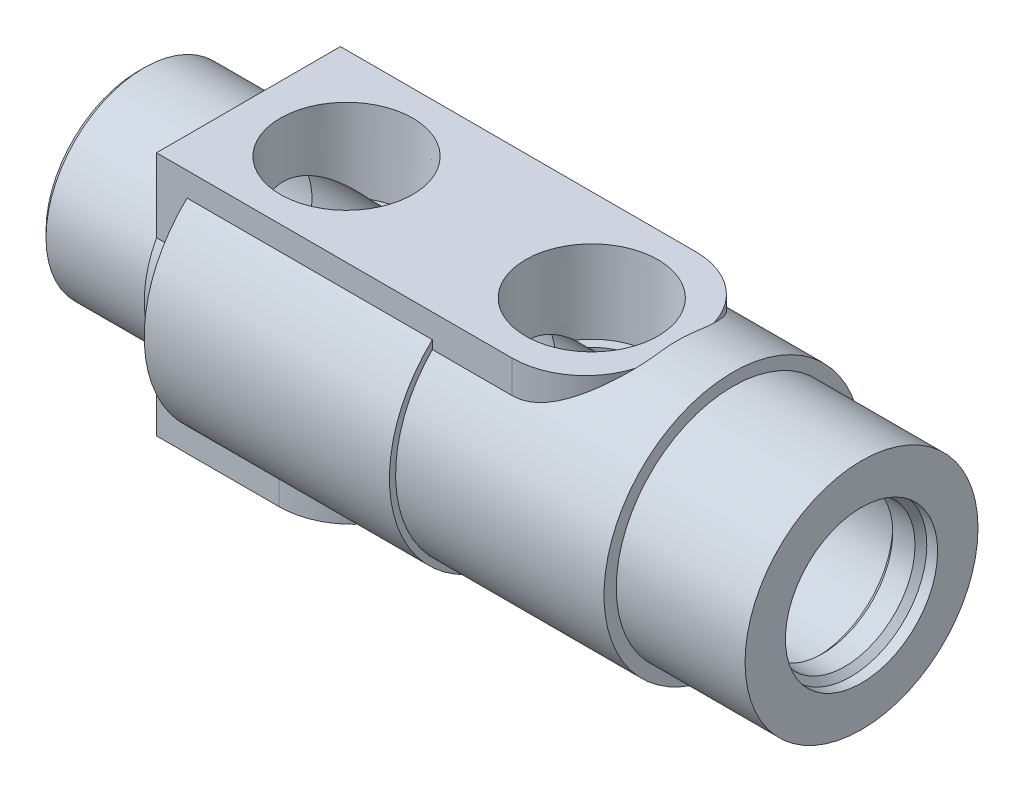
ISO-10303-21;
HEADER;
FILE_DESCRIPTION(('STEP AP214'),'2;1');
FILE_NAME('part.step','',(''),(''),'','','');
FILE_SCHEMA(('AUTOMOTIVE_DESIGN { 1 0 10303 214 1 1 1 1 }'));
ENDSEC;
DATA;
#1=APPLICATION_CONTEXT('core data for automotive mechanical design processes');
#2=APPLICATION_PROTOCOL_DEFINITION('international standard','automotive_design',2000,#1);
#3=PRODUCT_CONTEXT('',#1,'mechanical');
#4=PRODUCT('Part','Part','',(#3));
#5=PRODUCT_RELATED_PRODUCT_CATEGORY('part','',(#4));
#6=PRODUCT_DEFINITION_FORMATION('','',#4);
#7=PRODUCT_DEFINITION_CONTEXT('part definition',#1,'design');
#8=PRODUCT_DEFINITION('design','',#6,#7);
#9=PRODUCT_DEFINITION_SHAPE('','',#8);
#10=(LENGTH_UNIT() NAMED_UNIT(*) SI_UNIT(.MILLI.,.METRE.));
#11=(NAMED_UNIT(*) PLANE_ANGLE_UNIT() SI_UNIT($,.RADIAN.));
#12=(NAMED_UNIT(*) SI_UNIT($,.STERADIAN.) SOLID_ANGLE_UNIT());
#13=UNCERTAINTY_MEASURE_WITH_UNIT(LENGTH_MEASURE(1.E-05),#10,'distance_accuracy_value','');
#14=(GEOMETRIC_REPRESENTATION_CONTEXT(3) GLOBAL_UNCERTAINTY_ASSIGNED_CONTEXT((#13)) GLOBAL_UNIT_ASSIGNED_CONTEXT((#10,
#11,#12)) REPRESENTATION_CONTEXT('',''));
#15=CARTESIAN_POINT('',(0.,0.,0.));
#16=DIRECTION('',(0.,0.,1.));
#17=DIRECTION('',(1.,0.,0.));
#18=AXIS2_PLACEMENT_3D('',#15,#16,#17);
#19=CARTESIAN_POINT('',(-57.15,8.92810000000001,0.));
#20=DIRECTION('',(1.,0.,0.));
#21=DIRECTION('',(0.,0.,-1.));
#22=AXIS2_PLACEMENT_3D('',#19,#20,#21);
#23=PLANE('',#22);
#24=CARTESIAN_POINT('',(-57.15,0.,0.));
#25=DIRECTION('',(-1.,0.,0.));
#26=DIRECTION('',(0.,0.,1.));
#27=AXIS2_PLACEMENT_3D('',#24,#25,#26);
#28=CIRCLE('',#27,8.92810000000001);
#29=CARTESIAN_POINT('',(-57.15,0.,8.92810000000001));
#30=VERTEX_POINT('',#29);
#31=EDGE_CURVE('E520',#30,#30,#28,.T.);
#32=ORIENTED_EDGE('',*,*,#31,.T.);
#33=EDGE_LOOP('',(#32));
#34=FACE_BOUND('',#33,.T.);
#35=CARTESIAN_POINT('',(-57.15,0.,0.));
#36=DIRECTION('',(-1.,0.,0.));
#37=DIRECTION('',(0.,0.,1.));
#38=AXIS2_PLACEMENT_3D('',#35,#36,#37);
#39=CIRCLE('',#38,8.5727286);
#40=CARTESIAN_POINT('',(-57.15,0.,8.57272860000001));
#41=VERTEX_POINT('',#40);
#42=EDGE_CURVE('E523',#41,#41,#39,.T.);
#43=ORIENTED_EDGE('',*,*,#42,.F.);
#44=EDGE_LOOP('',(#43));
#45=FACE_BOUND('',#44,.T.);
#46=ADVANCED_FACE('F32',(#34,#45),#23,.F.);
#47=CARTESIAN_POINT('',(-66.675,-5.56259999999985,-8.03205001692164));
#48=DIRECTION('',(0.,-1.,0.));
#49=DIRECTION('',(0.,0.,-1.));
#50=AXIS2_PLACEMENT_3D('',#47,#48,#49);
#51=PLANE('',#50);
#52=DIRECTION('',(-1.,0.,0.));
#53=VECTOR('',#52,1.);
#54=CARTESIAN_POINT('',(-93.6498,-5.56259999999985,6.98344118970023));
#55=LINE('',#54,#53);
#56=CARTESIAN_POINT('',(-62.7069555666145,-5.56259999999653,6.98344118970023));
#57=VERTEX_POINT('',#56);
#58=CARTESIAN_POINT('',(-70.643044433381,-5.56259999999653,6.9834411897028));
#59=VERTEX_POINT('',#58);
#60=EDGE_CURVE('E333',#57,#59,#55,.T.);
#61=ORIENTED_EDGE('',*,*,#60,.F.);
#62=CARTESIAN_POINT('',(-66.675,-5.56259999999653,0.));
#63=DIRECTION('',(0.,-1.,0.));
#64=DIRECTION('',(1.,0.,0.));
#65=AXIS2_PLACEMENT_3D('',#62,#63,#64);
#66=CIRCLE('',#65,8.03205001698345);
#67=EDGE_CURVE('E248',#57,#59,#66,.T.);
#68=ORIENTED_EDGE('',*,*,#67,.T.);
#69=EDGE_LOOP('',(#61,#68));
#70=FACE_BOUND('',#69,.T.);
#71=ADVANCED_FACE('F508',(#70),#51,.T.);
#72=CARTESIAN_POINT('',(-65.9448136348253,5.56259999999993,0.));
#73=DIRECTION('',(0.,1.,0.));
#74=DIRECTION('',(0.,0.,1.));
#75=AXIS2_PLACEMENT_3D('',#72,#73,#74);
#76=PLANE('',#75);
#77=DIRECTION('',(-1.,0.,0.));
#78=VECTOR('',#77,1.);
#79=CARTESIAN_POINT('',(-93.6498,5.56259999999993,-6.98344118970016));
#80=LINE('',#79,#78);
#81=CARTESIAN_POINT('',(-62.7069532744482,5.56259994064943,-6.98344118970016));
#82=VERTEX_POINT('',#81);
#83=CARTESIAN_POINT('',(-70.6430466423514,5.56259994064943,-6.98344123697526));
#84=VERTEX_POINT('',#83);
#85=EDGE_CURVE('E61',#82,#84,#80,.T.);
#86=ORIENTED_EDGE('',*,*,#85,.F.);
#87=CARTESIAN_POINT('',(-66.675,5.56259994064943,0.));
#88=DIRECTION('',(0.,1.,0.));
#89=DIRECTION('',(-1.,0.,0.));
#90=AXIS2_PLACEMENT_3D('',#87,#88,#89);
#91=CIRCLE('',#90,8.03205114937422);
#92=EDGE_CURVE('E242',#82,#84,#91,.T.);
#93=ORIENTED_EDGE('',*,*,#92,.T.);
#94=EDGE_LOOP('',(#86,#93));
#95=FACE_BOUND('',#94,.T.);
#96=ADVANCED_FACE('F513',(#95),#76,.T.);
#97=CARTESIAN_POINT('',(-39.6875,0.,0.));
#98=DIRECTION('',(1.,0.,0.));
#99=DIRECTION('',(0.,0.,-1.));
#100=AXIS2_PLACEMENT_3D('',#97,#98,#99);
#101=CYLINDRICAL_SURFACE('',#100,13.49375);
#102=CARTESIAN_POINT('',(-75.409764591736,0.,0.));
#103=DIRECTION('',(1.,0.,0.));
#104=DIRECTION('',(0.,0.,-1.));
#105=AXIS2_PLACEMENT_3D('',#102,#103,#104);
#106=CIRCLE('',#105,13.49375);
#107=CARTESIAN_POINT('',(-75.409764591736,-6.34999999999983,-11.90625));
#108=VERTEX_POINT('',#107);
#109=CARTESIAN_POINT('',(-75.409764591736,6.35,-11.90625));
#110=VERTEX_POINT('',#109);
#111=EDGE_CURVE('E419',#108,#110,#106,.T.);
#112=ORIENTED_EDGE('',*,*,#111,.F.);
#113=DIRECTION('',(1.,0.,0.));
#114=VECTOR('',#113,1.);
#115=CARTESIAN_POINT('',(-39.6875,-6.34999999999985,-11.90625));
#116=LINE('',#115,#114);
#117=CARTESIAN_POINT('',(-79.375,-6.34999999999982,-11.90625));
#118=VERTEX_POINT('',#117);
#119=EDGE_CURVE('E692',#108,#118,#116,.F.);
#120=ORIENTED_EDGE('',*,*,#119,.T.);
#121=CARTESIAN_POINT('',(-79.375,0.,0.));
#122=DIRECTION('',(1.,0.,0.));
#123=DIRECTION('',(0.,0.,-1.));
#124=AXIS2_PLACEMENT_3D('',#121,#122,#123);
#125=CIRCLE('',#124,13.49375);
#126=CARTESIAN_POINT('',(-79.375,6.35,-11.90625));
#127=VERTEX_POINT('',#126);
#128=EDGE_CURVE('E265',#118,#127,#125,.T.);
#129=ORIENTED_EDGE('',*,*,#128,.T.);
#130=DIRECTION('',(1.,0.,0.));
#131=VECTOR('',#130,1.);
#132=CARTESIAN_POINT('',(-39.6875,6.35,-11.90625));
#133=LINE('',#132,#131);
#134=EDGE_CURVE('E750',#127,#110,#133,.T.);
#135=ORIENTED_EDGE('',*,*,#134,.T.);
#136=EDGE_LOOP('',(#112,#120,#129,#135));
#137=FACE_BOUND('',#136,.T.);
#138=ADVANCED_FACE('F621',(#137),#101,.T.);
#139=CARTESIAN_POINT('',(-17.7798920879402,0.,0.));
#140=DIRECTION('',(1.,0.,0.));
#141=DIRECTION('',(0.,0.,-1.));
#142=AXIS2_PLACEMENT_3D('',#139,#140,#141);
#143=CONICAL_SURFACE('',#142,9.85520088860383,0.785398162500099);
#144=CARTESIAN_POINT('',(-17.7798911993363,0.,0.));
#145=DIRECTION('',(1.,0.,0.));
#146=DIRECTION('',(0.,0.,-1.));
#147=AXIS2_PLACEMENT_3D('',#144,#145,#146);
#148=CIRCLE('',#147,9.8552);
#149=CARTESIAN_POINT('',(-17.7798911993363,0.,-9.85519999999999));
#150=VERTEX_POINT('',#149);
#151=EDGE_CURVE('E272',#150,#150,#148,.T.);
#152=ORIENTED_EDGE('',*,*,#151,.T.);
#153=EDGE_LOOP('',(#152));
#154=FACE_BOUND('',#153,.T.);
#155=CARTESIAN_POINT('',(-18.5427665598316,0.,0.));
#156=DIRECTION('',(1.,0.,0.));
#157=DIRECTION('',(0.,0.,-1.));
#158=AXIS2_PLACEMENT_3D('',#155,#156,#157);
#159=CIRCLE('',#158,9.09232641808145);
#160=CARTESIAN_POINT('',(-18.5427665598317,0.,-9.09232641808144));
#161=VERTEX_POINT('',#160);
#162=EDGE_CURVE('E269',#161,#161,#159,.T.);
#163=ORIENTED_EDGE('',*,*,#162,.F.);
#164=EDGE_LOOP('',(#163));
#165=FACE_BOUND('',#164,.T.);
#166=ADVANCED_FACE('F498',(#154,#165),#143,.F.);
#167=CARTESIAN_POINT('',(-11.7958906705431,0.,0.));
#168=DIRECTION('',(1.,0.,0.));
#169=DIRECTION('',(0.,0.,-1.));
#170=AXIS2_PLACEMENT_3D('',#167,#168,#169);
#171=CYLINDRICAL_SURFACE('',#170,9.8552);
#172=CARTESIAN_POINT('',(-5.81188925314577,0.,0.));
#173=DIRECTION('',(-1.,0.,0.));
#174=DIRECTION('',(0.,-1.,0.));
#175=AXIS2_PLACEMENT_3D('',#172,#173,#174);
#176=CIRCLE('',#175,9.85520088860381);
#177=CARTESIAN_POINT('',(-5.81188925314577,-9.85520088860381,0.));
#178=VERTEX_POINT('',#177);
#179=EDGE_CURVE('E260',#178,#178,#176,.F.);
#180=ORIENTED_EDGE('',*,*,#179,.T.);
#181=EDGE_LOOP('',(#180));
#182=FACE_BOUND('',#181,.T.);
#183=ORIENTED_EDGE('',*,*,#151,.F.);
#184=EDGE_LOOP('',(#183));
#185=FACE_BOUND('',#184,.T.);
#186=ADVANCED_FACE('F951',(#182,#185),#171,.F.);
#187=CARTESIAN_POINT('',(-18.5427656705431,0.,-7.91801276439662));
#188=DIRECTION('',(1.,0.,0.));
#189=DIRECTION('',(0.,0.,-1.));
#190=AXIS2_PLACEMENT_3D('',#187,#188,#189);
#191=PLANE('',#190);
#192=CARTESIAN_POINT('',(-18.5427656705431,0.,0.));
#193=DIRECTION('',(1.,0.,0.));
#194=DIRECTION('',(0.,0.,-1.));
#195=AXIS2_PLACEMENT_3D('',#192,#193,#194);
#196=CIRCLE('',#195,7.1374);
#197=CARTESIAN_POINT('',(-18.5427656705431,0.,-7.13739999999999));
#198=VERTEX_POINT('',#197);
#199=EDGE_CURVE('E578',#198,#198,#196,.T.);
#200=ORIENTED_EDGE('',*,*,#199,.F.);
#201=EDGE_LOOP('',(#200));
#202=FACE_BOUND('',#201,.T.);
#203=ORIENTED_EDGE('',*,*,#162,.T.);
#204=EDGE_LOOP('',(#203));
#205=FACE_BOUND('',#204,.T.);
#206=ADVANCED_FACE('F956',(#202,#205),#191,.T.);
#207=CARTESIAN_POINT('',(-34.925,5.5625999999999,0.));
#208=DIRECTION('',(0.,-1.,0.));
#209=DIRECTION('',(1.,0.,0.));
#210=AXIS2_PLACEMENT_3D('',#207,#208,#209);
#211=CYLINDRICAL_SURFACE('',#210,6.7437);
#212=CARTESIAN_POINT('',(-34.925,5.56259999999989,0.));
#213=DIRECTION('',(0.,-1.,0.));
#214=DIRECTION('',(1.,0.,0.));
#215=AXIS2_PLACEMENT_3D('',#212,#213,#214);
#216=CIRCLE('',#215,6.7437);
#217=CARTESIAN_POINT('',(-39.9725270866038,5.56259999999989,-4.47213148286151));
#218=VERTEX_POINT('',#217);
#219=CARTESIAN_POINT('',(-29.8774729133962,5.5625999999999,-4.4721314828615));
#220=VERTEX_POINT('',#219);
#221=EDGE_CURVE('E257',#218,#220,#216,.T.);
#222=ORIENTED_EDGE('',*,*,#221,.F.);
#223=CARTESIAN_POINT('',(-39.9725270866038,5.5625999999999,-4.4721314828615));
#224=CARTESIAN_POINT('',(-39.8907577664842,5.48840580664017,-4.56441272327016));
#225=CARTESIAN_POINT('',(-39.8070682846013,5.4127793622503,-4.65378072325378));
#226=CARTESIAN_POINT('',(-39.6361115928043,5.25910221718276,-4.82677087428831));
#227=CARTESIAN_POINT('',(-39.5488453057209,5.18105214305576,-4.91039449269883));
#228=CARTESIAN_POINT('',(-39.2821006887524,4.94394837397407,-5.1527563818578));
#229=CARTESIAN_POINT('',(-39.0975932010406,4.78186504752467,-5.30307904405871));
#230=CARTESIAN_POINT('',(-38.716669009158,4.45336255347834,-5.58179514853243));
#231=CARTESIAN_POINT('',(-38.5202583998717,4.28694562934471,-5.71019968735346));
#232=CARTESIAN_POINT('',(-38.115552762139,3.95363624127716,-5.94581702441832));
#233=CARTESIAN_POINT('',(-37.9072623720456,3.78674398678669,-6.05303802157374));
#234=CARTESIAN_POINT('',(-37.6012808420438,3.5530408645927,-6.19071304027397));
#235=CARTESIAN_POINT('',(-37.5090764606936,3.48401538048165,-6.22978032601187));
#236=CARTESIAN_POINT('',(-37.3219821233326,3.34759503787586,-6.3041342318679));
#237=CARTESIAN_POINT('',(-37.2270925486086,3.28019995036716,-6.33942138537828));
#238=CARTESIAN_POINT('',(-37.0341580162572,3.14779256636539,-6.40619853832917));
#239=CARTESIAN_POINT('',(-36.9361093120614,3.08278331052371,-6.43768380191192));
#240=CARTESIAN_POINT('',(-36.7365122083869,2.95645435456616,-6.49667058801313));
#241=CARTESIAN_POINT('',(-36.6349642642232,2.89513417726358,-6.52417262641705));
#242=CARTESIAN_POINT('',(-36.3736628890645,2.74709638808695,-6.58827189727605));
#243=CARTESIAN_POINT('',(-36.2112031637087,2.66383555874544,-6.62212017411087));
#244=CARTESIAN_POINT('',(-35.8751855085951,2.51896179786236,-6.67857628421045));
#245=CARTESIAN_POINT('',(-35.7016757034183,2.45726169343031,-6.70122953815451));
#246=CARTESIAN_POINT('',(-35.3960294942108,2.38155530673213,-6.72843558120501));
#247=CARTESIAN_POINT('',(-35.2664180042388,2.3589207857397,-6.73632654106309));
#248=CARTESIAN_POINT('',(-35.0050475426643,2.33550028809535,-6.74448670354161));
#249=CARTESIAN_POINT('',(-34.8732918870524,2.33468328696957,-6.74476672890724));
#250=CARTESIAN_POINT('',(-34.6121076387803,2.35497448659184,-6.737704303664));
#251=CARTESIAN_POINT('',(-34.4826744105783,2.37603251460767,-6.73037929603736));
#252=CARTESIAN_POINT('',(-34.2285596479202,2.43611291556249,-6.70886068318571));
#253=CARTESIAN_POINT('',(-34.103889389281,2.47517536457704,-6.69465175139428));
#254=CARTESIAN_POINT('',(-33.8661919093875,2.56407305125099,-6.6610922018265));
#255=CARTESIAN_POINT('',(-33.752892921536,2.61330916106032,-6.64201755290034));
#256=CARTESIAN_POINT('',(-33.5311267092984,2.72000233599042,-6.59904371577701));
#257=CARTESIAN_POINT('',(-33.422664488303,2.77746766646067,-6.57513966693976));
#258=CARTESIAN_POINT('',(-33.2095948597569,2.89825352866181,-6.52280307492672));
#259=CARTESIAN_POINT('',(-33.1050059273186,2.96159805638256,-6.49435159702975));
#260=CARTESIAN_POINT('',(-32.899504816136,3.09213995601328,-6.43322246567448));
#261=CARTESIAN_POINT('',(-32.7985940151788,3.15933874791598,-6.40054324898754));
#262=CARTESIAN_POINT('',(-32.5919137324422,3.30185253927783,-6.32828076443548));
#263=CARTESIAN_POINT('',(-32.4864146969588,3.37738359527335,-6.28835240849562));
#264=CARTESIAN_POINT('',(-32.2786875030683,3.53030356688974,-6.20379605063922));
#265=CARTESIAN_POINT('',(-32.1764599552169,3.60769282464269,-6.15916717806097));
#266=CARTESIAN_POINT('',(-31.8740281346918,3.84147165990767,-6.0181924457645));
#267=CARTESIAN_POINT('',(-31.6782164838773,3.99937137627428,-5.91480848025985));
#268=CARTESIAN_POINT('',(-31.2978347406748,4.31393885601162,-5.6894488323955));
#269=CARTESIAN_POINT('',(-31.113232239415,4.47060890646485,-5.56753070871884));
#270=CARTESIAN_POINT('',(-30.754876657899,4.7798257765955,-5.30442280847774));
#271=CARTESIAN_POINT('',(-30.5811134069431,4.93237638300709,-5.16325150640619));
#272=CARTESIAN_POINT('',(-30.3201130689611,5.16412233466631,-4.92830606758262));
#273=CARTESIAN_POINT('',(-30.2287914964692,5.24574260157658,-4.84140734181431));
#274=CARTESIAN_POINT('',(-30.0501099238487,5.4062940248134,-4.66143595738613));
#275=CARTESIAN_POINT('',(-29.9627475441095,5.48522678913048,-4.56836709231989));
#276=CARTESIAN_POINT('',(-29.8774729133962,5.56259999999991,-4.4721314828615));
#277=B_SPLINE_CURVE_WITH_KNOTS('',3,(#223,#224,#225,#226,#227,#228,#229,#230,#231,#232,#233,
#234,#235,#236,#237,#238,#239,#240,#241,#242,#243,#244,#245,#246,#247,#248,#249,#250,#251,#252,
#253,#254,#255,#256,#257,#258,#259,#260,#261,#262,#263,#264,#265,#266,#267,#268,#269,#270,#271,
#272,#273,#274,#275,#276),.UNSPECIFIED.,.F.,.F.,(4,2,2,2,2,2,2,2,2,2,2,2,2,2,2,2,2,2,2,2,2,2,2,
2,2,2,4),(0.,0.431579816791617,0.863048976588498,1.72554968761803,2.58761243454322,
3.44934087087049,3.81414025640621,4.17888809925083,4.54408570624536,4.90923597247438,
5.46504644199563,6.01858296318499,6.41224035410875,6.80533793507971,7.19753589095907,
7.59061108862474,7.96503460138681,8.33983685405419,8.71624244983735,9.09278762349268,
9.49989591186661,9.90707974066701,10.7219889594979,11.53441727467,12.3460714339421,
12.7964181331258,13.2464904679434),.UNSPECIFIED.);
#278=EDGE_CURVE('E541',#218,#220,#277,.T.);
#279=ORIENTED_EDGE('',*,*,#278,.T.);
#280=EDGE_LOOP('',(#222,#279));
#281=FACE_BOUND('',#280,.T.);
#282=ADVANCED_FACE('F1132',(#281),#211,.F.);
#283=CARTESIAN_POINT('',(-34.925,5.5625999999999,0.));
#284=DIRECTION('',(0.,-1.,0.));
#285=DIRECTION('',(1.,0.,0.));
#286=AXIS2_PLACEMENT_3D('',#283,#284,#285);
#287=CYLINDRICAL_SURFACE('',#286,6.7437);
#288=CARTESIAN_POINT('',(-34.925,5.56259999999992,0.));
#289=DIRECTION('',(0.,-1.,0.));
#290=DIRECTION('',(1.,0.,0.));
#291=AXIS2_PLACEMENT_3D('',#288,#289,#290);
#292=CIRCLE('',#291,6.7437);
#293=CARTESIAN_POINT('',(-29.877472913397,5.56259999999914,4.47213148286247));
#294=VERTEX_POINT('',#293);
#295=CARTESIAN_POINT('',(-39.9725270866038,5.56259999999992,4.47213148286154));
#296=VERTEX_POINT('',#295);
#297=EDGE_CURVE('E236',#294,#296,#292,.T.);
#298=ORIENTED_EDGE('',*,*,#297,.F.);
#299=CARTESIAN_POINT('',(-29.877472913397,5.56259999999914,4.47213148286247));
#300=CARTESIAN_POINT('',(-29.9592422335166,5.4884058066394,4.56441272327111));
#301=CARTESIAN_POINT('',(-30.0429317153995,5.41277936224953,4.65378072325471));
#302=CARTESIAN_POINT('',(-30.2138884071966,5.25910221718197,4.8267708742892));
#303=CARTESIAN_POINT('',(-30.30115469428,5.18105214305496,4.9103944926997));
#304=CARTESIAN_POINT('',(-30.5678993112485,4.94394837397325,5.1527563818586));
#305=CARTESIAN_POINT('',(-30.7524067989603,4.78186504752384,5.30307904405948));
#306=CARTESIAN_POINT('',(-31.1333309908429,4.4533625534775,5.58179514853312));
#307=CARTESIAN_POINT('',(-31.3297416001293,4.28694562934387,5.71019968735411));
#308=CARTESIAN_POINT('',(-31.734447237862,3.95363624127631,5.94581702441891));
#309=CARTESIAN_POINT('',(-31.9427376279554,3.78674398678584,6.0530380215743));
#310=CARTESIAN_POINT('',(-32.2487191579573,3.55304086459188,6.19071304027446));
#311=CARTESIAN_POINT('',(-32.3409235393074,3.48401538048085,6.22978032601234));
#312=CARTESIAN_POINT('',(-32.5280178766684,3.34759503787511,6.30413423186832));
#313=CARTESIAN_POINT('',(-32.6229074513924,3.28019995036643,6.33942138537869));
#314=CARTESIAN_POINT('',(-32.8158419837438,3.1477925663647,6.40619853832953));
#315=CARTESIAN_POINT('',(-32.9138906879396,3.08278331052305,6.43768380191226));
#316=CARTESIAN_POINT('',(-33.113487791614,2.95645435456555,6.49667058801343));
#317=CARTESIAN_POINT('',(-33.2150357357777,2.895134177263,6.52417262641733));
#318=CARTESIAN_POINT('',(-33.4763371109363,2.74709638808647,6.58827189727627));
#319=CARTESIAN_POINT('',(-33.638796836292,2.66383555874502,6.62212017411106));
#320=CARTESIAN_POINT('',(-33.9748144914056,2.51896179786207,6.67857628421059));
#321=CARTESIAN_POINT('',(-34.1483242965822,2.45726169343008,6.70122953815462));
#322=CARTESIAN_POINT('',(-34.4539705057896,2.38155530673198,6.72843558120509));
#323=CARTESIAN_POINT('',(-34.5835819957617,2.35892078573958,6.73632654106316));
#324=CARTESIAN_POINT('',(-34.8449524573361,2.33550028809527,6.74448670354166));
#325=CARTESIAN_POINT('',(-34.9767081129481,2.33468328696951,6.74476672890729));
#326=CARTESIAN_POINT('',(-35.2378923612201,2.35497448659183,6.73770430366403));
#327=CARTESIAN_POINT('',(-35.3673255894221,2.37603251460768,6.73037929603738));
#328=CARTESIAN_POINT('',(-35.6214403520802,2.43611291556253,6.70886068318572));
#329=CARTESIAN_POINT('',(-35.7461106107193,2.4751753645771,6.69465175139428));
#330=CARTESIAN_POINT('',(-35.9838080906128,2.56407305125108,6.66109220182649));
#331=CARTESIAN_POINT('',(-36.0971070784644,2.61330916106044,6.64201755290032));
#332=CARTESIAN_POINT('',(-36.3188732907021,2.72000233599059,6.59904371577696));
#333=CARTESIAN_POINT('',(-36.4273355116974,2.77746766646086,6.57513966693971));
#334=CARTESIAN_POINT('',(-36.6404051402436,2.89825352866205,6.52280307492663));
#335=CARTESIAN_POINT('',(-36.7449940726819,2.96159805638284,6.49435159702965));
#336=CARTESIAN_POINT('',(-36.9504951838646,3.09213995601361,6.43322246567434));
#337=CARTESIAN_POINT('',(-37.0514059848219,3.15933874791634,6.40054324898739));
#338=CARTESIAN_POINT('',(-37.2580862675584,3.30185253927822,6.32828076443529));
#339=CARTESIAN_POINT('',(-37.3635853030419,3.37738359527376,6.28835240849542));
#340=CARTESIAN_POINT('',(-37.5713124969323,3.53030356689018,6.20379605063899));
#341=CARTESIAN_POINT('',(-37.6735400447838,3.60769282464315,6.15916717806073));
#342=CARTESIAN_POINT('',(-37.9759718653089,3.84147165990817,6.0181924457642));
#343=CARTESIAN_POINT('',(-38.1717835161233,3.99937137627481,5.91480848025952));
#344=CARTESIAN_POINT('',(-38.5521652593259,4.31393885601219,5.68944883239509));
#345=CARTESIAN_POINT('',(-38.7367677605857,4.47060890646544,5.56753070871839));
#346=CARTESIAN_POINT('',(-39.0951233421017,4.77982577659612,5.30442280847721));
#347=CARTESIAN_POINT('',(-39.2688865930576,4.93237638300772,5.16325150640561));
#348=CARTESIAN_POINT('',(-39.5298869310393,5.16412233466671,4.92830606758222));
#349=CARTESIAN_POINT('',(-39.621208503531,5.24574260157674,4.84140734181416));
#350=CARTESIAN_POINT('',(-39.799890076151,5.40629402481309,4.66143595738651));
#351=CARTESIAN_POINT('',(-39.8872524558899,5.48522678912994,4.56836709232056));
#352=CARTESIAN_POINT('',(-39.972527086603,5.56259999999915,4.47213148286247));
#353=B_SPLINE_CURVE_WITH_KNOTS('',3,(#299,#300,#301,#302,#303,#304,#305,#306,#307,#308,#309,
#310,#311,#312,#313,#314,#315,#316,#317,#318,#319,#320,#321,#322,#323,#324,#325,#326,#327,#328,
#329,#330,#331,#332,#333,#334,#335,#336,#337,#338,#339,#340,#341,#342,#343,#344,#345,#346,#347,
#348,#349,#350,#351,#352),.UNSPECIFIED.,.F.,.F.,(4,2,2,2,2,2,2,2,2,2,2,2,2,2,2,2,2,2,2,2,2,2,2,
2,2,2,4),(0.,0.431579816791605,0.863048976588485,1.725549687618,2.5876124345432,
3.44934087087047,3.8141402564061,4.17888809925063,4.54408570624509,4.909235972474,
5.46504644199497,6.01858296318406,6.41224035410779,6.80533793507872,7.19753589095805,
7.59061108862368,7.96503460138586,8.33983685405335,8.71624244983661,9.09278762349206,
9.49989591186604,9.9070797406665,10.7219889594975,11.5344172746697,12.3460714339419,
12.7964181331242,13.2464904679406),.UNSPECIFIED.);
#354=EDGE_CURVE('E533',#294,#296,#353,.T.);
#355=ORIENTED_EDGE('',*,*,#354,.T.);
#356=EDGE_LOOP('',(#298,#355));
#357=FACE_BOUND('',#356,.T.);
#358=ADVANCED_FACE('F548',(#357),#287,.F.);
#359=CARTESIAN_POINT('',(-5.81188925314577,0.,0.));
#360=DIRECTION('',(-1.,0.,0.));
#361=DIRECTION('',(0.,0.,1.));
#362=AXIS2_PLACEMENT_3D('',#359,#360,#361);
#363=CONICAL_SURFACE('',#362,9.85520088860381,0.785398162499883);
#364=CARTESIAN_POINT('',(-5.04901567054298,0.,0.));
#365=DIRECTION('',(1.,0.,0.));
#366=DIRECTION('',(0.,0.,-1.));
#367=AXIS2_PLACEMENT_3D('',#364,#365,#366);
#368=CIRCLE('',#367,9.09232552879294);
#369=CARTESIAN_POINT('',(-5.04901567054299,0.,-9.09232552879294));
#370=VERTEX_POINT('',#369);
#371=EDGE_CURVE('E256',#370,#370,#368,.T.);
#372=ORIENTED_EDGE('',*,*,#371,.T.);
#373=EDGE_LOOP('',(#372));
#374=FACE_BOUND('',#373,.T.);
#375=ORIENTED_EDGE('',*,*,#179,.F.);
#376=EDGE_LOOP('',(#375));
#377=FACE_BOUND('',#376,.T.);
#378=ADVANCED_FACE('F599',(#374,#377),#363,.F.);
#379=DIRECTION('',(-1.,0.,0.));
#380=VECTOR('',#379,1.);
#381=CARTESIAN_POINT('',(-93.6498,-5.56259999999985,-6.98344118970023));
#382=LINE('',#381,#380);
#383=CARTESIAN_POINT('',(-70.6430444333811,-5.56259999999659,-6.98344118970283));
#384=VERTEX_POINT('',#383);
#385=CARTESIAN_POINT('',(-62.7069555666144,-5.56259999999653,-6.98344118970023));
#386=VERTEX_POINT('',#385);
#387=EDGE_CURVE('E586',#384,#386,#382,.F.);
#388=ORIENTED_EDGE('',*,*,#387,.F.);
#389=EDGE_CURVE('E254',#384,#386,#66,.T.);
#390=ORIENTED_EDGE('',*,*,#389,.T.);
#391=EDGE_LOOP('',(#388,#390));
#392=FACE_BOUND('',#391,.T.);
#393=ADVANCED_FACE('F516',(#392),#51,.T.);
#394=CARTESIAN_POINT('',(-34.1948136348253,5.5625999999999,0.));
#395=DIRECTION('',(0.,1.,0.));
#396=DIRECTION('',(0.,0.,1.));
#397=AXIS2_PLACEMENT_3D('',#394,#395,#396);
#398=PLANE('',#397);
#399=DIRECTION('',(-1.,0.,0.));
#400=VECTOR('',#399,1.);
#401=CARTESIAN_POINT('',(-57.15,5.5625999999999,-4.47213148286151));
#402=LINE('',#401,#400);
#403=CARTESIAN_POINT('',(-28.2531272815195,5.56259982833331,-4.47213148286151));
#404=VERTEX_POINT('',#403);
#405=EDGE_CURVE('E534',#404,#220,#402,.T.);
#406=ORIENTED_EDGE('',*,*,#405,.F.);
#407=CARTESIAN_POINT('',(-34.925,5.56259982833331,0.));
#408=DIRECTION('',(0.,1.,0.));
#409=DIRECTION('',(-1.,0.,0.));
#410=AXIS2_PLACEMENT_3D('',#407,#408,#409);
#411=CIRCLE('',#410,8.03205114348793);
#412=CARTESIAN_POINT('',(-41.5968725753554,5.56259982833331,-4.47213169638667));
#413=VERTEX_POINT('',#412);
#414=EDGE_CURVE('E243',#404,#413,#411,.T.);
#415=ORIENTED_EDGE('',*,*,#414,.T.);
#416=EDGE_CURVE('E53',#218,#413,#402,.T.);
#417=ORIENTED_EDGE('',*,*,#416,.F.);
#418=ORIENTED_EDGE('',*,*,#221,.T.);
#419=EDGE_LOOP('',(#406,#415,#417,#418));
#420=FACE_BOUND('',#419,.T.);
#421=ADVANCED_FACE('F598',(#420),#398,.T.);
#422=CARTESIAN_POINT('',(-34.1948136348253,5.5625999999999,0.));
#423=DIRECTION('',(0.,1.,0.));
#424=DIRECTION('',(0.,0.,1.));
#425=AXIS2_PLACEMENT_3D('',#422,#423,#424);
#426=PLANE('',#425);
#427=DIRECTION('',(-1.,0.,0.));
#428=VECTOR('',#427,1.);
#429=CARTESIAN_POINT('',(-57.15,5.5625999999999,4.47213148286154));
#430=LINE('',#429,#428);
#431=CARTESIAN_POINT('',(-41.5968726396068,5.56259989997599,4.47213160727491));
#432=VERTEX_POINT('',#431);
#433=EDGE_CURVE('E222',#432,#296,#430,.F.);
#434=ORIENTED_EDGE('',*,*,#433,.F.);
#435=CARTESIAN_POINT('',(-34.925,5.562599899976,0.));
#436=DIRECTION('',(0.,1.,0.));
#437=DIRECTION('',(-1.,0.,0.));
#438=AXIS2_PLACEMENT_3D('',#435,#436,#437);
#439=CIRCLE('',#438,8.03205114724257);
#440=CARTESIAN_POINT('',(-28.2531272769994,5.562599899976,4.47213148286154));
#441=VERTEX_POINT('',#440);
#442=EDGE_CURVE('E234',#432,#441,#439,.T.);
#443=ORIENTED_EDGE('',*,*,#442,.T.);
#444=EDGE_CURVE('E239',#294,#441,#430,.F.);
#445=ORIENTED_EDGE('',*,*,#444,.F.);
#446=ORIENTED_EDGE('',*,*,#297,.T.);
#447=EDGE_LOOP('',(#434,#443,#445,#446));
#448=FACE_BOUND('',#447,.T.);
#449=ADVANCED_FACE('F232',(#448),#426,.T.);
#450=DIRECTION('',(-1.,0.,0.));
#451=VECTOR('',#450,1.);
#452=CARTESIAN_POINT('',(-93.6498,5.56259999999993,6.98344118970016));
#453=LINE('',#452,#451);
#454=CARTESIAN_POINT('',(-70.6430466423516,5.56259994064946,6.98344123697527));
#455=VERTEX_POINT('',#454);
#456=CARTESIAN_POINT('',(-62.7069532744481,5.56259994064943,6.98344118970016));
#457=VERTEX_POINT('',#456);
#458=EDGE_CURVE('E332',#455,#457,#453,.F.);
#459=ORIENTED_EDGE('',*,*,#458,.F.);
#460=EDGE_CURVE('E246',#455,#457,#91,.T.);
#461=ORIENTED_EDGE('',*,*,#460,.T.);
#462=EDGE_LOOP('',(#459,#461));
#463=FACE_BOUND('',#462,.T.);
#464=ADVANCED_FACE('F610',(#463),#76,.T.);
#465=CARTESIAN_POINT('',(-3.60720366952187,0.,0.));
#466=DIRECTION('',(1.,0.,0.));
#467=DIRECTION('',(0.,0.,-1.));
#468=AXIS2_PLACEMENT_3D('',#465,#466,#467);
#469=CYLINDRICAL_SURFACE('',#468,9.09232552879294);
#470=CARTESIAN_POINT('',(-2.16539255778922,0.,0.));
#471=DIRECTION('',(1.,0.,0.));
#472=DIRECTION('',(0.,1.,0.));
#473=AXIS2_PLACEMENT_3D('',#470,#471,#472);
#474=CIRCLE('',#473,9.09232641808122);
#475=CARTESIAN_POINT('',(-2.16539255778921,9.09232641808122,0.));
#476=VERTEX_POINT('',#475);
#477=EDGE_CURVE('E280',#476,#476,#474,.T.);
#478=ORIENTED_EDGE('',*,*,#477,.T.);
#479=EDGE_LOOP('',(#478));
#480=FACE_BOUND('',#479,.T.);
#481=ORIENTED_EDGE('',*,*,#371,.F.);
#482=EDGE_LOOP('',(#481));
#483=FACE_BOUND('',#482,.T.);
#484=ADVANCED_FACE('F612',(#480,#483),#469,.F.);
#485=CARTESIAN_POINT('',(-66.675,-15.8750000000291,0.));
#486=DIRECTION('',(0.,-1.,0.));
#487=DIRECTION('',(1.,0.,0.));
#488=AXIS2_PLACEMENT_3D('',#485,#486,#487);
#489=CONICAL_SURFACE('',#488,8.57249999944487,0.052359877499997);
#490=ORIENTED_EDGE('',*,*,#67,.F.);
#491=CARTESIAN_POINT('',(-62.7072571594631,-5.5623999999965,6.98360049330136));
#492=CARTESIAN_POINT('',(-62.5840731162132,-5.64411488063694,6.91852439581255));
#493=CARTESIAN_POINT('',(-62.4629266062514,-5.72655004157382,6.85051248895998));
#494=CARTESIAN_POINT('',(-62.2246508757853,-5.89216337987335,6.70859429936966));
#495=CARTESIAN_POINT('',(-62.1075218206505,-5.97534158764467,6.63468777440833));
#496=CARTESIAN_POINT('',(-61.8769850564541,-6.1419160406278,6.480797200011));
#497=CARTESIAN_POINT('',(-61.7635859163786,-6.22531236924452,6.40080038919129));
#498=CARTESIAN_POINT('',(-61.5408286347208,-6.39152828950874,6.23483217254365));
#499=CARTESIAN_POINT('',(-61.4314704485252,-6.47434788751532,6.14886083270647));
#500=CARTESIAN_POINT('',(-61.1072784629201,-6.72285451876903,5.87998009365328));
#501=CARTESIAN_POINT('',(-60.8987516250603,-6.88681604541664,5.68771572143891));
#502=CARTESIAN_POINT('',(-60.5003565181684,-7.20546315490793,5.27821084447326));
#503=CARTESIAN_POINT('',(-60.3104685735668,-7.36015845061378,5.06099721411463));
#504=CARTESIAN_POINT('',(-60.0161695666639,-7.60288561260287,4.68378477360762));
#505=CARTESIAN_POINT('',(-59.9055228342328,-7.69493194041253,4.5311970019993));
#506=CARTESIAN_POINT('',(-59.6938266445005,-7.87219964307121,4.21570488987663));
#507=CARTESIAN_POINT('',(-59.5927766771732,-7.95742138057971,4.05280109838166));
#508=CARTESIAN_POINT('',(-59.4017186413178,-8.11940518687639,3.71762530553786));
#509=CARTESIAN_POINT('',(-59.3116682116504,-8.19619958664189,3.54539318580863));
#510=CARTESIAN_POINT('',(-59.1433115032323,-8.34037424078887,3.19149070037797));
#511=CARTESIAN_POINT('',(-59.0650034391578,-8.40775592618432,3.00982177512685));
#512=CARTESIAN_POINT('',(-58.9324533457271,-8.52218048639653,2.66662480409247));
#513=CARTESIAN_POINT('',(-58.8763623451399,-8.57075729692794,2.5063209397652));
#514=CARTESIAN_POINT('',(-58.7741847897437,-8.65943794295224,2.18028235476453));
#515=CARTESIAN_POINT('',(-58.7280964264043,-8.69954331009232,2.01454862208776));
#516=CARTESIAN_POINT('',(-58.6465883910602,-8.77058292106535,1.67849455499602));
#517=CARTESIAN_POINT('',(-58.6111713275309,-8.80151492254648,1.50817311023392));
#518=CARTESIAN_POINT('',(-58.5516017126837,-8.8535953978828,1.16408399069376));
#519=CARTESIAN_POINT('',(-58.5274492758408,-8.8747437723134,0.99031628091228));
#520=CARTESIAN_POINT('',(-58.4907729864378,-8.90687524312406,0.639991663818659));
#521=CARTESIAN_POINT('',(-58.4782905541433,-8.91782213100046,0.463427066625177));
#522=CARTESIAN_POINT('',(-58.4653356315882,-8.92918360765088,0.109516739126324));
#523=CARTESIAN_POINT('',(-58.4648631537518,-8.92959818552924,-0.0678289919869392));
#524=CARTESIAN_POINT('',(-58.4759367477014,-8.91988625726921,-0.42184801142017));
#525=CARTESIAN_POINT('',(-58.4874825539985,-8.90975998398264,-0.598521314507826));
#526=CARTESIAN_POINT('',(-58.5223763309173,-8.87918648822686,-0.949788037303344));
#527=CARTESIAN_POINT('',(-58.5457240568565,-8.85873947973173,-1.12438150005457));
#528=CARTESIAN_POINT('',(-58.6020594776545,-8.80947725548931,-1.45982133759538));
#529=CARTESIAN_POINT('',(-58.6343857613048,-8.78123683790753,-1.62086460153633));
#530=CARTESIAN_POINT('',(-58.7086329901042,-8.71649496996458,-1.9390876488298));
#531=CARTESIAN_POINT('',(-58.7505575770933,-8.679990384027,-2.09626594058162));
#532=CARTESIAN_POINT('',(-58.8434087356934,-8.59933339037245,-2.40582783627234));
#533=CARTESIAN_POINT('',(-58.8943308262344,-8.55518478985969,-2.55821378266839));
#534=CARTESIAN_POINT('',(-59.0045856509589,-8.45987096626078,-2.8576662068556));
#535=CARTESIAN_POINT('',(-59.0639200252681,-8.40870437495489,-3.00473164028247));
#536=CARTESIAN_POINT('',(-59.2127452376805,-8.28080759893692,-3.34404986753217));
#537=CARTESIAN_POINT('',(-59.3054808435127,-8.20143546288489,-3.53389385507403));
#538=CARTESIAN_POINT('',(-59.5037307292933,-8.03275831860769,-3.90215554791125));
#539=CARTESIAN_POINT('',(-59.6092488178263,-7.94345035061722,-4.08056982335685));
#540=CARTESIAN_POINT('',(-59.8321368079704,-7.7561793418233,-4.42622196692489));
#541=CARTESIAN_POINT('',(-59.9495528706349,-7.65818279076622,-4.59341176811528));
#542=CARTESIAN_POINT('',(-60.1946780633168,-7.45544134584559,-4.91564937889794));
#543=CARTESIAN_POINT('',(-60.3223869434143,-7.35069661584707,-5.07069748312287));
#544=CARTESIAN_POINT('',(-60.6179399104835,-7.1109704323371,-5.40336016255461));
#545=CARTESIAN_POINT('',(-60.7882108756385,-6.97462209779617,-5.57783730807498));
#546=CARTESIAN_POINT('',(-61.1416373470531,-6.69664848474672,-5.90868693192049));
#547=CARTESIAN_POINT('',(-61.324798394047,-6.55502094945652,-6.06505154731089));
#548=CARTESIAN_POINT('',(-61.701255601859,-6.27077630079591,-6.35842656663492));
#549=CARTESIAN_POINT('',(-61.8944288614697,-6.12818414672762,-6.49561865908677));
#550=CARTESIAN_POINT('',(-62.1927638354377,-5.91488479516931,-6.68836981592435));
#551=CARTESIAN_POINT('',(-62.2935955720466,-5.84391169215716,-6.75042494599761));
#552=CARTESIAN_POINT('',(-62.4982026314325,-5.70258287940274,-6.8702336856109));
#553=CARTESIAN_POINT('',(-62.6019779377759,-5.63222716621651,-6.92798731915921));
#554=CARTESIAN_POINT('',(-62.7072571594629,-5.5623999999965,-6.98360049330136));
#555=B_SPLINE_CURVE_WITH_KNOTS('',3,(#491,#492,#493,#494,#495,#496,#497,#498,#499,#500,#501,
#502,#503,#504,#505,#506,#507,#508,#509,#510,#511,#512,#513,#514,#515,#516,#517,#518,#519,#520,
#521,#522,#523,#524,#525,#526,#527,#528,#529,#530,#531,#532,#533,#534,#535,#536,#537,#538,#539,
#540,#541,#542,#543,#544,#545,#546,#547,#548,#549,#550,#551,#552,#553,#554),.UNSPECIFIED.,.F.,
.F.,(4,2,2,2,2,2,2,2,2,2,2,2,2,2,2,2,2,2,2,2,2,2,2,2,2,2,2,2,2,2,2,4),(0.,0.484488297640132,
0.968996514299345,1.45454948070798,1.94009708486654,2.92138098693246,3.90161762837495,
4.5303820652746,5.15911306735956,5.78534079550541,6.41147321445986,6.94087748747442,
7.47018596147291,7.99962371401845,8.52906684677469,9.06038207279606,9.59169784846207,
10.1230018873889,10.6542949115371,11.1537547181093,11.6534043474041,12.1528058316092,
12.6523048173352,13.3284184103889,14.0047339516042,14.6837819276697,15.3628134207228,
16.1997583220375,17.037065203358,17.8658033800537,18.2798382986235,18.6938709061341),.UNSPECIFIED.);
#556=EDGE_CURVE('E228',#57,#386,#555,.T.);
#557=ORIENTED_EDGE('',*,*,#556,.T.);
#558=ORIENTED_EDGE('',*,*,#389,.F.);
#559=CARTESIAN_POINT('',(-70.6427428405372,-5.5623999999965,-6.98360049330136));
#560=CARTESIAN_POINT('',(-70.765926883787,-5.64411488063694,-6.91852439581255));
#561=CARTESIAN_POINT('',(-70.8870733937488,-5.72655004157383,-6.85051248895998));
#562=CARTESIAN_POINT('',(-71.1253491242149,-5.89216337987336,-6.70859429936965));
#563=CARTESIAN_POINT('',(-71.2424781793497,-5.97534158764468,-6.63468777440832));
#564=CARTESIAN_POINT('',(-71.4730149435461,-6.14191604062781,-6.48079720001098));
#565=CARTESIAN_POINT('',(-71.5864140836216,-6.22531236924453,-6.40080038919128));
#566=CARTESIAN_POINT('',(-71.8091713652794,-6.39152828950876,-6.23483217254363));
#567=CARTESIAN_POINT('',(-71.918529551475,-6.47434788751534,-6.14886083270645));
#568=CARTESIAN_POINT('',(-72.2427215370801,-6.72285451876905,-5.87998009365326));
#569=CARTESIAN_POINT('',(-72.4512483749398,-6.88681604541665,-5.68771572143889));
#570=CARTESIAN_POINT('',(-72.8496434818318,-7.20546315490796,-5.27821084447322));
#571=CARTESIAN_POINT('',(-73.0395314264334,-7.36015845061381,-5.06099721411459));
#572=CARTESIAN_POINT('',(-73.3338304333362,-7.6028856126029,-4.68378477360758));
#573=CARTESIAN_POINT('',(-73.4444771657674,-7.69493194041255,-4.53119700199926));
#574=CARTESIAN_POINT('',(-73.6561733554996,-7.87219964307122,-4.21570488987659));
#575=CARTESIAN_POINT('',(-73.7572233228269,-7.95742138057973,-4.05280109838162));
#576=CARTESIAN_POINT('',(-73.9482813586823,-8.1194051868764,-3.71762530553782));
#577=CARTESIAN_POINT('',(-74.0383317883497,-8.19619958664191,-3.54539318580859));
#578=CARTESIAN_POINT('',(-74.2066884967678,-8.34037424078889,-3.19149070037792));
#579=CARTESIAN_POINT('',(-74.2849965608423,-8.40775592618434,-3.0098217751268));
#580=CARTESIAN_POINT('',(-74.417546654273,-8.52218048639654,-2.66662480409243));
#581=CARTESIAN_POINT('',(-74.4736376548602,-8.57075729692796,-2.50632093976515));
#582=CARTESIAN_POINT('',(-74.5758152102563,-8.65943794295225,-2.18028235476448));
#583=CARTESIAN_POINT('',(-74.6219035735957,-8.69954331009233,-2.0145486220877));
#584=CARTESIAN_POINT('',(-74.7034116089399,-8.77058292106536,-1.67849455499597));
#585=CARTESIAN_POINT('',(-74.7388286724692,-8.80151492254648,-1.50817311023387));
#586=CARTESIAN_POINT('',(-74.7983982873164,-8.8535953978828,-1.1640839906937));
#587=CARTESIAN_POINT('',(-74.8225507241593,-8.8747437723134,-0.990316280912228));
#588=CARTESIAN_POINT('',(-74.8592270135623,-8.90687524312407,-0.639991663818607));
#589=CARTESIAN_POINT('',(-74.8717094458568,-8.91782213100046,-0.463427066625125));
#590=CARTESIAN_POINT('',(-74.8846643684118,-8.92918360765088,-0.109516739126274));
#591=CARTESIAN_POINT('',(-74.8851368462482,-8.92959818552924,0.067828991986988));
#592=CARTESIAN_POINT('',(-74.8740632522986,-8.91988625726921,0.421848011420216));
#593=CARTESIAN_POINT('',(-74.8625174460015,-8.90975998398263,0.598521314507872));
#594=CARTESIAN_POINT('',(-74.8276236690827,-8.87918648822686,0.949788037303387));
#595=CARTESIAN_POINT('',(-74.8042759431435,-8.85873947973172,1.12438150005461));
#596=CARTESIAN_POINT('',(-74.7479405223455,-8.80947725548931,1.45982133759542));
#597=CARTESIAN_POINT('',(-74.7156142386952,-8.78123683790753,1.62086460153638));
#598=CARTESIAN_POINT('',(-74.6413670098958,-8.71649496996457,1.93908764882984));
#599=CARTESIAN_POINT('',(-74.5994424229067,-8.679990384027,2.09626594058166));
#600=CARTESIAN_POINT('',(-74.5065912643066,-8.59933339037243,2.40582783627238));
#601=CARTESIAN_POINT('',(-74.4556691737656,-8.55518478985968,2.55821378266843));
#602=CARTESIAN_POINT('',(-74.3454143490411,-8.45987096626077,2.85766620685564));
#603=CARTESIAN_POINT('',(-74.2860799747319,-8.40870437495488,3.0047316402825));
#604=CARTESIAN_POINT('',(-74.1372547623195,-8.28080759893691,3.34404986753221));
#605=CARTESIAN_POINT('',(-74.0445191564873,-8.20143546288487,3.53389385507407));
#606=CARTESIAN_POINT('',(-73.8462692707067,-8.03275831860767,3.90215554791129));
#607=CARTESIAN_POINT('',(-73.7407511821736,-7.94345035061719,4.08056982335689));
#608=CARTESIAN_POINT('',(-73.5178631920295,-7.75617934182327,4.42622196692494));
#609=CARTESIAN_POINT('',(-73.4004471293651,-7.6581827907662,4.59341176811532));
#610=CARTESIAN_POINT('',(-73.1553219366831,-7.45544134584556,4.91564937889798));
#611=CARTESIAN_POINT('',(-73.0276130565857,-7.35069661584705,5.0706974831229));
#612=CARTESIAN_POINT('',(-72.7320600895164,-7.11097043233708,5.40336016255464));
#613=CARTESIAN_POINT('',(-72.5617891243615,-6.97462209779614,5.57783730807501));
#614=CARTESIAN_POINT('',(-72.2083626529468,-6.6966484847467,5.90868693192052));
#615=CARTESIAN_POINT('',(-72.0252016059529,-6.5550209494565,6.06505154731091));
#616=CARTESIAN_POINT('',(-71.6487443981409,-6.2707763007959,6.35842656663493));
#617=CARTESIAN_POINT('',(-71.4555711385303,-6.12818414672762,6.49561865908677));
#618=CARTESIAN_POINT('',(-71.1572361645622,-5.91488479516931,6.68836981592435));
#619=CARTESIAN_POINT('',(-71.0564044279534,-5.84391169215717,6.75042494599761));
#620=CARTESIAN_POINT('',(-70.8517973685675,-5.70258287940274,6.8702336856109));
#621=CARTESIAN_POINT('',(-70.748022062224,-5.63222716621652,6.92798731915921));
#622=CARTESIAN_POINT('',(-70.642742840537,-5.56239999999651,6.98360049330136));
#623=B_SPLINE_CURVE_WITH_KNOTS('',3,(#559,#560,#561,#562,#563,#564,#565,#566,#567,#568,#569,
#570,#571,#572,#573,#574,#575,#576,#577,#578,#579,#580,#581,#582,#583,#584,#585,#586,#587,#588,
#589,#590,#591,#592,#593,#594,#595,#596,#597,#598,#599,#600,#601,#602,#603,#604,#605,#606,#607,
#608,#609,#610,#611,#612,#613,#614,#615,#616,#617,#618,#619,#620,#621,#622),.UNSPECIFIED.,.F.,
.F.,(4,2,2,2,2,2,2,2,2,2,2,2,2,2,2,2,2,2,2,2,2,2,2,2,2,2,2,2,2,2,2,4),(0.,0.484488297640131,
0.968996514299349,1.45454948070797,1.94009708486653,2.92138098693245,3.90161762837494,
4.53038206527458,5.15911306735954,5.78534079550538,6.41147321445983,6.94087748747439,
7.47018596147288,7.99962371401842,8.52906684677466,9.06038207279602,9.59169784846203,
10.1230018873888,10.6542949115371,11.1537547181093,11.6534043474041,12.1528058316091,
12.6523048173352,13.3284184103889,14.0047339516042,14.6837819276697,15.3628134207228,
16.1997583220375,17.037065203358,17.8658033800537,18.2798382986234,18.6938709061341),.UNSPECIFIED.);
#624=EDGE_CURVE('E268',#384,#59,#623,.T.);
#625=ORIENTED_EDGE('',*,*,#624,.T.);
#626=EDGE_LOOP('',(#490,#557,#558,#625));
#627=FACE_BOUND('',#626,.T.);
#628=CARTESIAN_POINT('',(-66.675,-15.8750000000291,0.));
#629=DIRECTION('',(0.,-1.,0.));
#630=DIRECTION('',(1.,0.,0.));
#631=AXIS2_PLACEMENT_3D('',#628,#629,#630);
#632=CIRCLE('',#631,8.57249999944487);
#633=CARTESIAN_POINT('',(-58.1025000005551,-15.875000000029,0.));
#634=VERTEX_POINT('',#633);
#635=EDGE_CURVE('E283',#634,#634,#632,.T.);
#636=ORIENTED_EDGE('',*,*,#635,.T.);
#637=EDGE_LOOP('',(#636));
#638=FACE_BOUND('',#637,.T.);
#639=ADVANCED_FACE('F306',(#627,#638),#489,.F.);
#640=CARTESIAN_POINT('',(-34.925,15.8749999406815,0.));
#641=DIRECTION('',(0.,1.,0.));
#642=DIRECTION('',(-1.,0.,0.));
#643=AXIS2_PLACEMENT_3D('',#640,#641,#642);
#644=CONICAL_SURFACE('',#643,8.57250113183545,0.0523598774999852);
#645=ORIENTED_EDGE('',*,*,#414,.F.);
#646=CARTESIAN_POINT('',(-28.5587730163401,5.21975053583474,-4.86792390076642));
#647=CARTESIAN_POINT('',(-28.4564951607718,5.33519065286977,-4.74412823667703));
#648=CARTESIAN_POINT('',(-28.3565431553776,5.4472577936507,-4.61514268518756));
#649=CARTESIAN_POINT('',(-28.1623292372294,5.66387119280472,-4.34659419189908));
#650=CARTESIAN_POINT('',(-28.068075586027,5.76840657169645,-4.20701652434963));
#651=CARTESIAN_POINT('',(-27.8858978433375,5.96961720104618,-3.91632727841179));
#652=CARTESIAN_POINT('',(-27.7980277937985,6.0662260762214,-3.76513550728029));
#653=CARTESIAN_POINT('',(-27.630744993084,6.24952869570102,-3.45235016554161));
#654=CARTESIAN_POINT('',(-27.551332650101,6.33622196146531,-3.29075609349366));
#655=CARTESIAN_POINT('',(-27.4152415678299,6.48439955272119,-2.98639276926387));
#656=CARTESIAN_POINT('',(-27.3570038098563,6.54765324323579,-2.84518081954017));
#657=CARTESIAN_POINT('',(-27.2481337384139,6.66568997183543,-2.55643709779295));
#658=CARTESIAN_POINT('',(-27.1974998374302,6.72047477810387,-2.40890665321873));
#659=CARTESIAN_POINT('',(-27.1047722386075,6.82066487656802,-2.10855415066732));
#660=CARTESIAN_POINT('',(-27.0626557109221,6.86609524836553,-1.95574755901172));
#661=CARTESIAN_POINT('',(-26.9875692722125,6.94700639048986,-1.64538256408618));
#662=CARTESIAN_POINT('',(-26.9545954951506,6.98249136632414,-1.4878262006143));
#663=CARTESIAN_POINT('',(-26.8982160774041,7.04312238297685,-1.16774821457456));
#664=CARTESIAN_POINT('',(-26.8748857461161,7.06818705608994,-1.00519778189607));
#665=CARTESIAN_POINT('',(-26.8386727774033,7.107077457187,-0.677594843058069));
#666=CARTESIAN_POINT('',(-26.8257902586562,7.12090305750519,-0.512542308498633));
#667=CARTESIAN_POINT('',(-26.8107684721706,7.13702353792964,-0.181319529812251));
#668=CARTESIAN_POINT('',(-26.8086334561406,7.13931385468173,-0.0151488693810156));
#669=CARTESIAN_POINT('',(-26.8151699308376,7.13230017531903,0.3167247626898));
#670=CARTESIAN_POINT('',(-26.8238405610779,7.12299710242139,0.482427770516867));
#671=CARTESIAN_POINT('',(-26.8502962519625,7.09459572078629,0.794394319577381));
#672=CARTESIAN_POINT('',(-26.8670168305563,7.07664123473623,0.940855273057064));
#673=CARTESIAN_POINT('',(-26.9086282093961,7.03192621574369,1.23129562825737));
#674=CARTESIAN_POINT('',(-26.9335217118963,7.00516277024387,1.37527419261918));
#675=CARTESIAN_POINT('',(-26.991040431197,6.94326208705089,1.65974789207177));
#676=CARTESIAN_POINT('',(-27.0236610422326,6.90812983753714,1.80024504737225));
#677=CARTESIAN_POINT('',(-27.0961283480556,6.82998379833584,2.07714438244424));
#678=CARTESIAN_POINT('',(-27.1359777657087,6.78696703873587,2.21354499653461));
#679=CARTESIAN_POINT('',(-27.2698533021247,6.64222935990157,2.62905788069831));
#680=CARTESIAN_POINT('',(-27.3752911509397,6.52794642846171,2.90027346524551));
#681=CARTESIAN_POINT('',(-27.6100877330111,6.27219333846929,3.41845564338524));
#682=CARTESIAN_POINT('',(-27.7394739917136,6.13069188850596,3.66539382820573));
#683=CARTESIAN_POINT('',(-27.9826093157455,5.86299010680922,4.07580868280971));
#684=CARTESIAN_POINT('',(-28.0923694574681,5.74159528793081,4.24486863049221));
#685=CARTESIAN_POINT('',(-28.3199484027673,5.48825747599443,4.56764085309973));
#686=CARTESIAN_POINT('',(-28.4377317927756,5.35636045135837,4.72141403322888));
#687=CARTESIAN_POINT('',(-28.55877301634,5.21975053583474,4.86792390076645));
#688=B_SPLINE_CURVE_WITH_KNOTS('',3,(#646,#647,#648,#649,#650,#651,#652,#653,#654,#655,#656,
#657,#658,#659,#660,#661,#662,#663,#664,#665,#666,#667,#668,#669,#670,#671,#672,#673,#674,#675,
#676,#677,#678,#679,#680,#681,#682,#683,#684,#685,#686,#687),.UNSPECIFIED.,.F.,.F.,(4,2,2,2,2,2,
2,2,2,2,2,2,2,2,2,2,2,2,2,2,4),(0.,0.593312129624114,1.18746478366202,1.78617072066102,
2.38490553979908,2.88042105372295,3.37583297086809,3.86989885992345,4.36375551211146,
4.86139916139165,5.3590484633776,5.85689461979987,6.35470113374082,6.79969792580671,
7.24484199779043,7.68972140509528,8.13476873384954,9.06890040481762,10.0041124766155,
10.7091507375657,11.4112568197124),.UNSPECIFIED.);
#689=EDGE_CURVE('E11',#404,#441,#688,.T.);
#690=ORIENTED_EDGE('',*,*,#689,.T.);
#691=ORIENTED_EDGE('',*,*,#442,.F.);
#692=CARTESIAN_POINT('',(-41.2912269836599,5.21975053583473,4.86792390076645));
#693=CARTESIAN_POINT('',(-41.3935048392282,5.33519065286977,4.74412823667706));
#694=CARTESIAN_POINT('',(-41.4934568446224,5.4472577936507,4.61514268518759));
#695=CARTESIAN_POINT('',(-41.6876707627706,5.66387119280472,4.34659419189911));
#696=CARTESIAN_POINT('',(-41.781924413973,5.76840657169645,4.20701652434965));
#697=CARTESIAN_POINT('',(-41.9641021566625,5.96961720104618,3.91632727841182));
#698=CARTESIAN_POINT('',(-42.0519722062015,6.0662260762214,3.76513550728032));
#699=CARTESIAN_POINT('',(-42.219255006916,6.24952869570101,3.45235016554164));
#700=CARTESIAN_POINT('',(-42.298667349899,6.33622196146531,3.29075609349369));
#701=CARTESIAN_POINT('',(-42.4347584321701,6.48439955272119,2.98639276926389));
#702=CARTESIAN_POINT('',(-42.4929961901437,6.54765324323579,2.8451808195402));
#703=CARTESIAN_POINT('',(-42.6018662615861,6.66568997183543,2.55643709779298));
#704=CARTESIAN_POINT('',(-42.6525001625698,6.72047477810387,2.40890665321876));
#705=CARTESIAN_POINT('',(-42.7452277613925,6.82066487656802,2.10855415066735));
#706=CARTESIAN_POINT('',(-42.7873442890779,6.86609524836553,1.95574755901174));
#707=CARTESIAN_POINT('',(-42.8624307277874,6.94700639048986,1.64538256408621));
#708=CARTESIAN_POINT('',(-42.8954045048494,6.98249136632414,1.48782620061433));
#709=CARTESIAN_POINT('',(-42.9517839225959,7.04312238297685,1.16774821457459));
#710=CARTESIAN_POINT('',(-42.9751142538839,7.06818705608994,1.00519778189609));
#711=CARTESIAN_POINT('',(-43.0113272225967,7.10707745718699,0.677594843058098));
#712=CARTESIAN_POINT('',(-43.0242097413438,7.12090305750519,0.512542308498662));
#713=CARTESIAN_POINT('',(-43.0392315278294,7.13702353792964,0.181319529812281));
#714=CARTESIAN_POINT('',(-43.0413665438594,7.13931385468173,0.0151488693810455));
#715=CARTESIAN_POINT('',(-43.0348300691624,7.13230017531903,-0.316724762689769));
#716=CARTESIAN_POINT('',(-43.0261594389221,7.12299710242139,-0.482427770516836));
#717=CARTESIAN_POINT('',(-42.9997037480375,7.09459572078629,-0.794394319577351));
#718=CARTESIAN_POINT('',(-42.9829831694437,7.07664123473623,-0.940855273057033));
#719=CARTESIAN_POINT('',(-42.9413717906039,7.03192621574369,-1.23129562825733));
#720=CARTESIAN_POINT('',(-42.9164782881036,7.00516277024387,-1.37527419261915));
#721=CARTESIAN_POINT('',(-42.858959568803,6.94326208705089,-1.65974789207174));
#722=CARTESIAN_POINT('',(-42.8263389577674,6.90812983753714,-1.80024504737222));
#723=CARTESIAN_POINT('',(-42.7538716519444,6.82998379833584,-2.07714438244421));
#724=CARTESIAN_POINT('',(-42.7140222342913,6.78696703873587,-2.21354499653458));
#725=CARTESIAN_POINT('',(-42.5801466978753,6.64222935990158,-2.62905788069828));
#726=CARTESIAN_POINT('',(-42.4747088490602,6.52794642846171,-2.90027346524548));
#727=CARTESIAN_POINT('',(-42.2399122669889,6.2721933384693,-3.41845564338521));
#728=CARTESIAN_POINT('',(-42.1105260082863,6.13069188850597,-3.6653938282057));
#729=CARTESIAN_POINT('',(-41.8673906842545,5.86299010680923,-4.07580868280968));
#730=CARTESIAN_POINT('',(-41.7576305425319,5.74159528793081,-4.24486863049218));
#731=CARTESIAN_POINT('',(-41.5300515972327,5.48825747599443,-4.56764085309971));
#732=CARTESIAN_POINT('',(-41.4122682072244,5.35636045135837,-4.72141403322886));
#733=CARTESIAN_POINT('',(-41.2912269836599,5.21975053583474,-4.86792390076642));
#734=B_SPLINE_CURVE_WITH_KNOTS('',3,(#692,#693,#694,#695,#696,#697,#698,#699,#700,#701,#702,
#703,#704,#705,#706,#707,#708,#709,#710,#711,#712,#713,#714,#715,#716,#717,#718,#719,#720,#721,
#722,#723,#724,#725,#726,#727,#728,#729,#730,#731,#732,#733),.UNSPECIFIED.,.F.,.F.,(4,2,2,2,2,2,
2,2,2,2,2,2,2,2,2,2,2,2,2,2,4),(0.,0.59331212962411,1.18746478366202,1.78617072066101,
2.38490553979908,2.88042105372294,3.37583297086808,3.86989885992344,4.36375551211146,
4.86139916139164,5.35904846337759,5.85689461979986,6.35470113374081,6.7996979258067,
7.24484199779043,7.68972140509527,8.13476873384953,9.06890040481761,10.0041124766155,
10.7091507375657,11.4112568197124),.UNSPECIFIED.);
#735=EDGE_CURVE('E46',#432,#413,#734,.T.);
#736=ORIENTED_EDGE('',*,*,#735,.T.);
#737=EDGE_LOOP('',(#645,#690,#691,#736));
#738=FACE_BOUND('',#737,.T.);
#739=CARTESIAN_POINT('',(-34.925,15.8749999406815,0.));
#740=DIRECTION('',(0.,1.,0.));
#741=DIRECTION('',(-1.,0.,0.));
#742=AXIS2_PLACEMENT_3D('',#739,#740,#741);
#743=CIRCLE('',#742,8.57250113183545);
#744=CARTESIAN_POINT('',(-43.4975011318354,15.8749999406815,0.));
#745=VERTEX_POINT('',#744);
#746=EDGE_CURVE('E636',#745,#745,#743,.T.);
#747=ORIENTED_EDGE('',*,*,#746,.T.);
#748=EDGE_LOOP('',(#747));
#749=FACE_BOUND('',#748,.T.);
#750=ADVANCED_FACE('F240',(#738,#749),#644,.F.);
#751=CARTESIAN_POINT('',(-66.675,15.8749999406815,0.));
#752=DIRECTION('',(0.,1.,0.));
#753=DIRECTION('',(-1.,0.,0.));
#754=AXIS2_PLACEMENT_3D('',#751,#752,#753);
#755=CONICAL_SURFACE('',#754,8.57250113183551,0.0523598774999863);
#756=ORIENTED_EDGE('',*,*,#92,.F.);
#757=CARTESIAN_POINT('',(-62.7072549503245,5.56239994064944,-6.98360054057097));
#758=CARTESIAN_POINT('',(-62.5840709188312,5.64411485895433,-6.91852441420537));
#759=CARTESIAN_POINT('',(-62.4629244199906,5.72655005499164,-6.85051247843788));
#760=CARTESIAN_POINT('',(-62.2246487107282,5.89216345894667,-6.70859423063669));
#761=CARTESIAN_POINT('',(-62.107519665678,5.97534169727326,-6.6346876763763));
#762=CARTESIAN_POINT('',(-61.8769829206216,6.14191620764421,-6.48079704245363));
#763=CARTESIAN_POINT('',(-61.7635837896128,6.22531256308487,-6.40080020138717));
#764=CARTESIAN_POINT('',(-61.5408265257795,6.39152853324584,-6.23483192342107));
#765=CARTESIAN_POINT('',(-61.4314683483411,6.47434815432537,-6.14886055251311));
#766=CARTESIAN_POINT('',(-61.1072763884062,6.7228548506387,-5.87997971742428));
#767=CARTESIAN_POINT('',(-60.8987495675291,6.88681641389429,-5.68771527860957));
#768=CARTESIAN_POINT('',(-60.5003544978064,7.20546358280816,-5.27821026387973));
#769=CARTESIAN_POINT('',(-60.3104665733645,7.36015890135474,-5.06099656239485));
#770=CARTESIAN_POINT('',(-60.0161676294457,7.60288606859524,-4.68378403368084));
#771=CARTESIAN_POINT('',(-59.9055209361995,7.69493238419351,-4.53119624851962));
#772=CARTESIAN_POINT('',(-59.6938248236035,7.87220005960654,-4.21570411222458));
#773=CARTESIAN_POINT('',(-59.5927748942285,7.95742178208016,-4.0528003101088));
#774=CARTESIAN_POINT('',(-59.4017169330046,8.11940555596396,-3.71762449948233));
#775=CARTESIAN_POINT('',(-59.3116665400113,8.19619993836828,-3.54539237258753));
#776=CARTESIAN_POINT('',(-59.1433099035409,8.34037455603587,-3.19148987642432));
#777=CARTESIAN_POINT('',(-59.0650018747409,8.40775622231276,-3.00982094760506));
#778=CARTESIAN_POINT('',(-58.9324518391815,8.52218075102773,-2.66662395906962));
#779=CARTESIAN_POINT('',(-58.8763608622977,8.570757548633,-2.50632007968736));
#780=CARTESIAN_POINT('',(-58.7741833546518,8.65943816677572,-2.18028146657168));
#781=CARTESIAN_POINT('',(-58.7280950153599,8.69954351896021,-2.01454772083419));
#782=CARTESIAN_POINT('',(-58.6465870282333,8.77058309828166,-1.6784936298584));
#783=CARTESIAN_POINT('',(-58.6111699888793,8.8015150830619,-1.50817217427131));
#784=CARTESIAN_POINT('',(-58.5516004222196,8.85359552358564,-1.16408303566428));
#785=CARTESIAN_POINT('',(-58.5274480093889,8.87474387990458,-0.990315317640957));
#786=CARTESIAN_POINT('',(-58.4907717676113,8.90687531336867,-0.639990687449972));
#787=CARTESIAN_POINT('',(-58.478289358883,8.91782218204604,-0.463426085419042));
#788=CARTESIAN_POINT('',(-58.4653344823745,8.92918361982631,-0.109515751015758));
#789=CARTESIAN_POINT('',(-58.4648620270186,8.92959817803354,0.0678299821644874));
#790=CARTESIAN_POINT('',(-58.475935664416,8.91988621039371,0.421849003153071));
#791=CARTESIAN_POINT('',(-58.4874814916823,8.90975991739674,0.598522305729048));
#792=CARTESIAN_POINT('',(-58.5223753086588,8.87918638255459,0.949789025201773));
#793=CARTESIAN_POINT('',(-58.545723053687,8.85873935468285,1.12438248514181));
#794=CARTESIAN_POINT('',(-58.6020585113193,8.80947709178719,1.45982232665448));
#795=CARTESIAN_POINT('',(-58.6343848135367,8.78123665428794,1.62086559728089));
#796=CARTESIAN_POINT('',(-58.7086320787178,8.71649474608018,1.93908865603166));
#797=CARTESIAN_POINT('',(-58.750556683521,8.67999013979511,2.09626695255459));
#798=CARTESIAN_POINT('',(-58.8434078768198,8.5993331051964,2.40582885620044));
#799=CARTESIAN_POINT('',(-58.8943299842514,8.55518448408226,2.55821480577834));
#800=CARTESIAN_POINT('',(-59.0045848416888,8.45987061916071,2.85766723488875));
#801=CARTESIAN_POINT('',(-59.0639192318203,8.40870400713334,3.00473267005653));
#802=CARTESIAN_POINT('',(-59.2127444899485,8.28080717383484,3.34405092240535));
#803=CARTESIAN_POINT('',(-59.3054801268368,8.20143499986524,3.53389493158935));
#804=CARTESIAN_POINT('',(-59.5037300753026,8.0327577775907,3.90215666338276));
#805=CARTESIAN_POINT('',(-59.6092481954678,7.94344976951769,4.08057095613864));
#806=CARTESIAN_POINT('',(-59.8321362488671,7.7561786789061,4.42622313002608));
#807=CARTESIAN_POINT('',(-59.9495523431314,7.65818208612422,4.59341294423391));
#808=CARTESIAN_POINT('',(-60.1946775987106,7.45544055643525,4.9156505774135));
#809=CARTESIAN_POINT('',(-60.3223865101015,7.35069578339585,5.07069869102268));
#810=CARTESIAN_POINT('',(-60.6179394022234,7.11096961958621,5.40336122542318));
#811=CARTESIAN_POINT('',(-60.7882102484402,6.97462135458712,5.57783823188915));
#812=CARTESIAN_POINT('',(-61.1416364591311,6.6966478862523,5.90868760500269));
#813=CARTESIAN_POINT('',(-61.32479736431,6.55502042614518,6.06505210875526));
#814=CARTESIAN_POINT('',(-61.7012542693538,6.27077592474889,6.35842693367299));
#815=CARTESIAN_POINT('',(-61.8944273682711,6.12818384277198,6.49561894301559));
#816=CARTESIAN_POINT('',(-62.1927620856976,5.91488459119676,6.68836999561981));
#817=CARTESIAN_POINT('',(-62.2935937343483,5.84391152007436,6.75042509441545));
#818=CARTESIAN_POINT('',(-62.4982006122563,5.7025827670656,6.87023377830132));
#819=CARTESIAN_POINT('',(-62.6019758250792,5.63222708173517,6.92798738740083));
#820=CARTESIAN_POINT('',(-62.7072549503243,5.56239994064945,6.98360054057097));
#821=B_SPLINE_CURVE_WITH_KNOTS('',3,(#757,#758,#759,#760,#761,#762,#763,#764,#765,#766,#767,
#768,#769,#770,#771,#772,#773,#774,#775,#776,#777,#778,#779,#780,#781,#782,#783,#784,#785,#786,
#787,#788,#789,#790,#791,#792,#793,#794,#795,#796,#797,#798,#799,#800,#801,#802,#803,#804,#805,
#806,#807,#808,#809,#810,#811,#812,#813,#814,#815,#816,#817,#818,#819,#820),.UNSPECIFIED.,.F.,
.F.,(4,2,2,2,2,2,2,2,2,2,2,2,2,2,2,2,2,2,2,2,2,2,2,2,2,2,2,2,2,2,2,4),(0.,0.48448836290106,
0.968996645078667,1.45454967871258,1.94009735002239,2.92138139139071,3.9016181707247,
4.53038255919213,5.15911351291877,5.78534119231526,6.41147356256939,6.94087784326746,
7.47018632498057,7.99962408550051,8.52906722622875,9.06038245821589,9.59169823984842,
10.1230022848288,10.6542953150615,11.1537551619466,11.6534048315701,12.1528063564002,
12.6523053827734,13.3284191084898,14.0047347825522,14.6837828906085,15.3628145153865,
16.1997588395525,17.0370651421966,17.8658027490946,18.2798373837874,18.6938697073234),.UNSPECIFIED.);
#822=EDGE_CURVE('E345',#82,#457,#821,.T.);
#823=ORIENTED_EDGE('',*,*,#822,.T.);
#824=ORIENTED_EDGE('',*,*,#460,.F.);
#825=CARTESIAN_POINT('',(-70.6427450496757,5.56239994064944,6.98360054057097));
#826=CARTESIAN_POINT('',(-70.765929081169,5.64411485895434,6.91852441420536));
#827=CARTESIAN_POINT('',(-70.8870755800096,5.72655005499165,6.85051247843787));
#828=CARTESIAN_POINT('',(-71.125351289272,5.89216345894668,6.70859423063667));
#829=CARTESIAN_POINT('',(-71.2424803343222,5.97534169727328,6.63468767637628));
#830=CARTESIAN_POINT('',(-71.4730170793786,6.14191620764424,6.48079704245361));
#831=CARTESIAN_POINT('',(-71.5864162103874,6.22531256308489,6.40080020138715));
#832=CARTESIAN_POINT('',(-71.8091734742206,6.39152853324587,6.23483192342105));
#833=CARTESIAN_POINT('',(-71.918531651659,6.4743481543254,6.14886055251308));
#834=CARTESIAN_POINT('',(-72.242723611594,6.72285485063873,5.87997971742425));
#835=CARTESIAN_POINT('',(-72.4512504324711,6.88681641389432,5.68771527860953));
#836=CARTESIAN_POINT('',(-72.8496455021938,7.20546358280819,5.27821026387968));
#837=CARTESIAN_POINT('',(-73.0395334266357,7.36015890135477,5.06099656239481));
#838=CARTESIAN_POINT('',(-73.3338323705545,7.60288606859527,4.6837840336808));
#839=CARTESIAN_POINT('',(-73.4444790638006,7.69493238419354,4.53119624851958));
#840=CARTESIAN_POINT('',(-73.6561751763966,7.87220005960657,4.21570411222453));
#841=CARTESIAN_POINT('',(-73.7572251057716,7.95742178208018,4.05280031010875));
#842=CARTESIAN_POINT('',(-73.9482830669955,8.11940555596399,3.71762449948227));
#843=CARTESIAN_POINT('',(-74.0383334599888,8.19619993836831,3.54539237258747));
#844=CARTESIAN_POINT('',(-74.2066900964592,8.34037455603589,3.19148987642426));
#845=CARTESIAN_POINT('',(-74.2849981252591,8.40775622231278,3.009820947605));
#846=CARTESIAN_POINT('',(-74.4175481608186,8.52218075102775,2.66662395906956));
#847=CARTESIAN_POINT('',(-74.4736391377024,8.57075754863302,2.5063200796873));
#848=CARTESIAN_POINT('',(-74.5758166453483,8.65943816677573,2.18028146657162));
#849=CARTESIAN_POINT('',(-74.6219049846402,8.69954351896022,2.01454772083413));
#850=CARTESIAN_POINT('',(-74.7034129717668,8.77058309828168,1.67849362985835));
#851=CARTESIAN_POINT('',(-74.7388300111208,8.80151508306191,1.50817217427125));
#852=CARTESIAN_POINT('',(-74.7983995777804,8.85359552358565,1.16408303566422));
#853=CARTESIAN_POINT('',(-74.8225519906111,8.87474387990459,0.990315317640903));
#854=CARTESIAN_POINT('',(-74.8592282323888,8.90687531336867,0.63999068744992));
#855=CARTESIAN_POINT('',(-74.8717106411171,8.91782218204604,0.463426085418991));
#856=CARTESIAN_POINT('',(-74.8846655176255,8.92918361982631,0.109515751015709));
#857=CARTESIAN_POINT('',(-74.8851379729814,8.92959817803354,-0.0678299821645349));
#858=CARTESIAN_POINT('',(-74.874064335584,8.91988621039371,-0.421849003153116));
#859=CARTESIAN_POINT('',(-74.8625185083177,8.90975991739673,-0.59852230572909));
#860=CARTESIAN_POINT('',(-74.8276246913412,8.87918638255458,-0.949789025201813));
#861=CARTESIAN_POINT('',(-74.804276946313,8.85873935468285,-1.12438248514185));
#862=CARTESIAN_POINT('',(-74.7479414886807,8.80947709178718,-1.45982232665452));
#863=CARTESIAN_POINT('',(-74.7156151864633,8.78123665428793,-1.62086559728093));
#864=CARTESIAN_POINT('',(-74.6413679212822,8.71649474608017,-1.93908865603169));
#865=CARTESIAN_POINT('',(-74.599443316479,8.67999013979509,-2.09626695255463));
#866=CARTESIAN_POINT('',(-74.5065921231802,8.59933310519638,-2.40582885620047));
#867=CARTESIAN_POINT('',(-74.4556700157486,8.55518448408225,-2.55821480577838));
#868=CARTESIAN_POINT('',(-74.3454151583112,8.45987061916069,-2.85766723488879));
#869=CARTESIAN_POINT('',(-74.2860807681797,8.40870400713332,-3.00473267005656));
#870=CARTESIAN_POINT('',(-74.1372555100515,8.28080717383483,-3.34405092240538));
#871=CARTESIAN_POINT('',(-74.0445198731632,8.20143499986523,-3.53389493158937));
#872=CARTESIAN_POINT('',(-73.8462699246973,8.03275777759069,-3.90215666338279));
#873=CARTESIAN_POINT('',(-73.7407518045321,7.94344976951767,-4.08057095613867));
#874=CARTESIAN_POINT('',(-73.5178637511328,7.75617867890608,-4.42622313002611));
#875=CARTESIAN_POINT('',(-73.4004476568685,7.6581820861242,-4.59341294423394));
#876=CARTESIAN_POINT('',(-73.1553224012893,7.45544055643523,-4.91565057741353));
#877=CARTESIAN_POINT('',(-73.0276134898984,7.35069578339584,-5.07069869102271));
#878=CARTESIAN_POINT('',(-72.7320605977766,7.1109696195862,-5.4033612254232));
#879=CARTESIAN_POINT('',(-72.5617897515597,6.97462135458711,-5.57783823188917));
#880=CARTESIAN_POINT('',(-72.2083635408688,6.69664788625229,-5.9086876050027));
#881=CARTESIAN_POINT('',(-72.0252026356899,6.55502042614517,-6.06505210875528));
#882=CARTESIAN_POINT('',(-71.6487457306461,6.27077592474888,-6.35842693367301));
#883=CARTESIAN_POINT('',(-71.4555726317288,6.12818384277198,-6.49561894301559));
#884=CARTESIAN_POINT('',(-71.1572379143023,5.91488459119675,-6.68836999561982));
#885=CARTESIAN_POINT('',(-71.0564062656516,5.84391152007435,-6.75042509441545));
#886=CARTESIAN_POINT('',(-70.8517993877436,5.70258276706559,-6.87023377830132));
#887=CARTESIAN_POINT('',(-70.7480241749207,5.63222708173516,-6.92798738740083));
#888=CARTESIAN_POINT('',(-70.6427450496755,5.56239994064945,-6.98360054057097));
#889=B_SPLINE_CURVE_WITH_KNOTS('',3,(#825,#826,#827,#828,#829,#830,#831,#832,#833,#834,#835,
#836,#837,#838,#839,#840,#841,#842,#843,#844,#845,#846,#847,#848,#849,#850,#851,#852,#853,#854,
#855,#856,#857,#858,#859,#860,#861,#862,#863,#864,#865,#866,#867,#868,#869,#870,#871,#872,#873,
#874,#875,#876,#877,#878,#879,#880,#881,#882,#883,#884,#885,#886,#887,#888),.UNSPECIFIED.,.F.,
.F.,(4,2,2,2,2,2,2,2,2,2,2,2,2,2,2,2,2,2,2,2,2,2,2,2,2,2,2,2,2,2,2,4),(0.,0.484488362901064,
0.968996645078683,1.45454967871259,1.9400973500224,2.92138139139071,3.9016181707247,
4.53038255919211,5.15911351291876,5.78534119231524,6.41147356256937,6.94087784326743,
7.47018632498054,7.99962408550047,8.5290672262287,9.06038245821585,9.59169823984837,
10.1230022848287,10.6542953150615,11.1537551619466,11.65340483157,12.1528063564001,
12.6523053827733,13.3284191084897,14.0047347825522,14.6837828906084,15.3628145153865,
16.1997588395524,17.0370651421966,17.8658027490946,18.2798373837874,18.6938697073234),.UNSPECIFIED.);
#890=EDGE_CURVE('E324',#455,#84,#889,.T.);
#891=ORIENTED_EDGE('',*,*,#890,.T.);
#892=EDGE_LOOP('',(#756,#823,#824,#891));
#893=FACE_BOUND('',#892,.T.);
#894=CARTESIAN_POINT('',(-66.675,15.8749999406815,0.));
#895=DIRECTION('',(0.,1.,0.));
#896=DIRECTION('',(-1.,0.,0.));
#897=AXIS2_PLACEMENT_3D('',#894,#895,#896);
#898=CIRCLE('',#897,8.57250113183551);
#899=CARTESIAN_POINT('',(-75.2475011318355,15.8749999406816,0.));
#900=VERTEX_POINT('',#899);
#901=EDGE_CURVE('E633',#900,#900,#898,.T.);
#902=ORIENTED_EDGE('',*,*,#901,.T.);
#903=EDGE_LOOP('',(#902));
#904=FACE_BOUND('',#903,.T.);
#905=ADVANCED_FACE('F336',(#893,#904),#755,.F.);
#906=CARTESIAN_POINT('',(-1.4025180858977,0.,0.));
#907=DIRECTION('',(1.,0.,0.));
#908=DIRECTION('',(0.,1.,0.));
#909=AXIS2_PLACEMENT_3D('',#906,#907,#908);
#910=CONICAL_SURFACE('',#909,9.85520088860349,0.785398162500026);
#911=ORIENTED_EDGE('',*,*,#477,.F.);
#912=EDGE_LOOP('',(#911));
#913=FACE_BOUND('',#912,.T.);
#914=CARTESIAN_POINT('',(-1.40251719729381,0.,0.));
#915=DIRECTION('',(1.,0.,0.));
#916=DIRECTION('',(0.,0.,-1.));
#917=AXIS2_PLACEMENT_3D('',#914,#915,#916);
#918=CIRCLE('',#917,9.8551999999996);
#919=CARTESIAN_POINT('',(-1.40251719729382,0.,-9.8551999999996));
#920=VERTEX_POINT('',#919);
#921=EDGE_CURVE('E284',#920,#920,#918,.T.);
#922=ORIENTED_EDGE('',*,*,#921,.T.);
#923=EDGE_LOOP('',(#922));
#924=FACE_BOUND('',#923,.T.);
#925=ADVANCED_FACE('F34',(#913,#924),#910,.F.);
#926=CARTESIAN_POINT('',(-39.6875,-15.875,0.));
#927=DIRECTION('',(0.,1.,0.));
#928=DIRECTION('',(0.,0.,1.));
#929=AXIS2_PLACEMENT_3D('',#926,#927,#928);
#930=PLANE('',#929);
#931=DIRECTION('',(-1.,0.,0.));
#932=VECTOR('',#931,1.);
#933=CARTESIAN_POINT('',(-79.375,-15.875,-11.90625));
#934=LINE('',#933,#932);
#935=CARTESIAN_POINT('',(-63.5,-15.875,-11.90625));
#936=VERTEX_POINT('',#935);
#937=CARTESIAN_POINT('',(-79.375,-15.875,-11.90625));
#938=VERTEX_POINT('',#937);
#939=EDGE_CURVE('E662',#936,#938,#934,.T.);
#940=ORIENTED_EDGE('',*,*,#939,.F.);
#941=CARTESIAN_POINT('',(-63.5,-15.875,-2.38124999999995));
#942=DIRECTION('',(0.,1.,0.));
#943=DIRECTION('',(-1.,0.,0.));
#944=AXIS2_PLACEMENT_3D('',#941,#942,#943);
#945=CIRCLE('',#944,9.525);
#946=CARTESIAN_POINT('',(-55.3281940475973,-15.875,-7.27483891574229));
#947=VERTEX_POINT('',#946);
#948=EDGE_CURVE('E663',#947,#936,#945,.T.);
#949=ORIENTED_EDGE('',*,*,#948,.F.);
#950=CARTESIAN_POINT('',(-53.975,-15.875,-2.38124999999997));
#951=VERTEX_POINT('',#950);
#952=EDGE_CURVE('E675',#951,#947,#945,.T.);
#953=ORIENTED_EDGE('',*,*,#952,.F.);
#954=DIRECTION('',(0.,0.,-1.));
#955=VECTOR('',#954,1.);
#956=CARTESIAN_POINT('',(-53.975,-15.875,-2.38124999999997));
#957=LINE('',#956,#955);
#958=CARTESIAN_POINT('',(-53.975,-15.875,2.38124999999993));
#959=VERTEX_POINT('',#958);
#960=EDGE_CURVE('E683',#959,#951,#957,.T.);
#961=ORIENTED_EDGE('',*,*,#960,.F.);
#962=CARTESIAN_POINT('',(-63.5,-15.875,2.3812499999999));
#963=DIRECTION('',(0.,1.,0.));
#964=DIRECTION('',(0.,0.,1.));
#965=AXIS2_PLACEMENT_3D('',#962,#963,#964);
#966=CIRCLE('',#965,9.525);
#967=CARTESIAN_POINT('',(-55.3281940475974,-15.875,7.27483891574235));
#968=VERTEX_POINT('',#967);
#969=EDGE_CURVE('E418',#968,#959,#966,.T.);
#970=ORIENTED_EDGE('',*,*,#969,.F.);
#971=CARTESIAN_POINT('',(-63.5,-15.875,2.3812499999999));
#972=DIRECTION('',(0.,1.,0.));
#973=DIRECTION('',(-1.,0.,0.));
#974=AXIS2_PLACEMENT_3D('',#971,#972,#973);
#975=CIRCLE('',#974,9.525);
#976=CARTESIAN_POINT('',(-63.5,-15.875,11.90625));
#977=VERTEX_POINT('',#976);
#978=EDGE_CURVE('E686',#977,#968,#975,.T.);
#979=ORIENTED_EDGE('',*,*,#978,.F.);
#980=DIRECTION('',(1.,0.,0.));
#981=VECTOR('',#980,1.);
#982=CARTESIAN_POINT('',(-33.3375,-15.875,11.90625));
#983=LINE('',#982,#981);
#984=CARTESIAN_POINT('',(-79.375,-15.875,11.90625));
#985=VERTEX_POINT('',#984);
#986=EDGE_CURVE('E287',#985,#977,#983,.T.);
#987=ORIENTED_EDGE('',*,*,#986,.F.);
#988=DIRECTION('',(0.,0.,1.));
#989=VECTOR('',#988,1.);
#990=CARTESIAN_POINT('',(-79.375,-15.875,11.90625));
#991=LINE('',#990,#989);
#992=EDGE_CURVE('E666',#938,#985,#991,.T.);
#993=ORIENTED_EDGE('',*,*,#992,.F.);
#994=EDGE_LOOP('',(#940,#949,#953,#961,#970,#979,#987,#993));
#995=FACE_BOUND('',#994,.T.);
#996=ORIENTED_EDGE('',*,*,#635,.F.);
#997=EDGE_LOOP('',(#996));
#998=FACE_BOUND('',#997,.T.);
#999=ADVANCED_FACE('F341',(#995,#998),#930,.F.);
#1000=CARTESIAN_POINT('',(-39.6875,15.875,0.));
#1001=DIRECTION('',(0.,-1.,0.));
#1002=DIRECTION('',(0.,0.,-1.));
#1003=AXIS2_PLACEMENT_3D('',#1000,#1001,#1002);
#1004=PLANE('',#1003);
#1005=DIRECTION('',(0.,0.,-1.));
#1006=VECTOR('',#1005,1.);
#1007=CARTESIAN_POINT('',(-23.8125,15.875,-2.38124999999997));
#1008=LINE('',#1007,#1006);
#1009=CARTESIAN_POINT('',(-23.8125,15.875,-2.38124999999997));
#1010=VERTEX_POINT('',#1009);
#1011=CARTESIAN_POINT('',(-23.8125,15.875,2.38124999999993));
#1012=VERTEX_POINT('',#1011);
#1013=EDGE_CURVE('E687',#1010,#1012,#1008,.F.);
#1014=ORIENTED_EDGE('',*,*,#1013,.F.);
#1015=CARTESIAN_POINT('',(-33.3375,15.875,-2.38124999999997));
#1016=DIRECTION('',(0.,-1.,0.));
#1017=DIRECTION('',(0.,0.,-1.));
#1018=AXIS2_PLACEMENT_3D('',#1015,#1016,#1017);
#1019=CIRCLE('',#1018,9.525);
#1020=CARTESIAN_POINT('',(-24.2035533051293,15.875,-5.08247986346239));
#1021=VERTEX_POINT('',#1020);
#1022=EDGE_CURVE('E275',#1021,#1010,#1019,.T.);
#1023=ORIENTED_EDGE('',*,*,#1022,.F.);
#1024=CARTESIAN_POINT('',(-33.3375,15.875,-2.38124999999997));
#1025=DIRECTION('',(0.,1.,0.));
#1026=DIRECTION('',(-1.,0.,0.));
#1027=AXIS2_PLACEMENT_3D('',#1024,#1025,#1026);
#1028=CIRCLE('',#1027,9.525);
#1029=CARTESIAN_POINT('',(-33.3375,15.875,-11.90625));
#1030=VERTEX_POINT('',#1029);
#1031=EDGE_CURVE('E644',#1030,#1021,#1028,.F.);
#1032=ORIENTED_EDGE('',*,*,#1031,.F.);
#1033=DIRECTION('',(-1.,0.,0.));
#1034=VECTOR('',#1033,1.);
#1035=CARTESIAN_POINT('',(-79.375,15.875,-11.90625));
#1036=LINE('',#1035,#1034);
#1037=CARTESIAN_POINT('',(-79.375,15.875,-11.90625));
#1038=VERTEX_POINT('',#1037);
#1039=EDGE_CURVE('E635',#1038,#1030,#1036,.F.);
#1040=ORIENTED_EDGE('',*,*,#1039,.F.);
#1041=DIRECTION('',(0.,0.,1.));
#1042=VECTOR('',#1041,1.);
#1043=CARTESIAN_POINT('',(-79.375,15.875,11.90625));
#1044=LINE('',#1043,#1042);
#1045=CARTESIAN_POINT('',(-79.375,15.875,11.90625));
#1046=VERTEX_POINT('',#1045);
#1047=EDGE_CURVE('E718',#1046,#1038,#1044,.F.);
#1048=ORIENTED_EDGE('',*,*,#1047,.F.);
#1049=DIRECTION('',(1.,0.,0.));
#1050=VECTOR('',#1049,1.);
#1051=CARTESIAN_POINT('',(-33.3375,15.875,11.90625));
#1052=LINE('',#1051,#1050);
#1053=CARTESIAN_POINT('',(-33.3375,15.875,11.90625));
#1054=VERTEX_POINT('',#1053);
#1055=EDGE_CURVE('E288',#1054,#1046,#1052,.F.);
#1056=ORIENTED_EDGE('',*,*,#1055,.F.);
#1057=CARTESIAN_POINT('',(-33.3375,15.875,2.3812499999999));
#1058=DIRECTION('',(0.,1.,0.));
#1059=DIRECTION('',(-1.,0.,0.));
#1060=AXIS2_PLACEMENT_3D('',#1057,#1058,#1059);
#1061=CIRCLE('',#1060,9.525);
#1062=CARTESIAN_POINT('',(-24.2035533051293,15.875,5.0824798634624));
#1063=VERTEX_POINT('',#1062);
#1064=EDGE_CURVE('E690',#1063,#1054,#1061,.F.);
#1065=ORIENTED_EDGE('',*,*,#1064,.F.);
#1066=EDGE_CURVE('E699',#1012,#1063,#1061,.F.);
#1067=ORIENTED_EDGE('',*,*,#1066,.F.);
#1068=EDGE_LOOP('',(#1014,#1023,#1032,#1040,#1048,#1056,#1065,#1067));
#1069=FACE_BOUND('',#1068,.T.);
#1070=ORIENTED_EDGE('',*,*,#901,.F.);
#1071=EDGE_LOOP('',(#1070));
#1072=FACE_BOUND('',#1071,.T.);
#1073=ORIENTED_EDGE('',*,*,#746,.F.);
#1074=EDGE_LOOP('',(#1073));
#1075=FACE_BOUND('',#1074,.T.);
#1076=ADVANCED_FACE('F650',(#1069,#1072,#1075),#1004,.F.);
#1077=CARTESIAN_POINT('',(-79.375,2.340812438E-13,-11.90625));
#1078=DIRECTION('',(0.,0.,-1.));
#1079=DIRECTION('',(-1.,0.,0.));
#1080=AXIS2_PLACEMENT_3D('',#1077,#1078,#1079);
#1081=PLANE('',#1080);
#1082=DIRECTION('',(-1.,0.,0.));
#1083=VECTOR('',#1082,1.);
#1084=CARTESIAN_POINT('',(-79.375,11.6656949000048,-11.90625));
#1085=LINE('',#1084,#1083);
#1086=CARTESIAN_POINT('',(-43.6597645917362,11.6656949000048,-11.90625));
#1087=VERTEX_POINT('',#1086);
#1088=CARTESIAN_POINT('',(-33.3375,11.6656949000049,-11.90625));
#1089=VERTEX_POINT('',#1088);
#1090=EDGE_CURVE('E409',#1087,#1089,#1085,.F.);
#1091=ORIENTED_EDGE('',*,*,#1090,.F.);
#1092=DIRECTION('',(0.,1.,0.));
#1093=VECTOR('',#1092,1.);
#1094=CARTESIAN_POINT('',(-43.659764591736,0.,-11.90625));
#1095=LINE('',#1094,#1093);
#1096=CARTESIAN_POINT('',(-43.659764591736,12.7741973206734,-11.90625));
#1097=VERTEX_POINT('',#1096);
#1098=EDGE_CURVE('E402',#1097,#1087,#1095,.F.);
#1099=ORIENTED_EDGE('',*,*,#1098,.F.);
#1100=DIRECTION('',(-1.,0.,0.));
#1101=VECTOR('',#1100,1.);
#1102=CARTESIAN_POINT('',(-79.375,12.7741973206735,-11.90625));
#1103=LINE('',#1102,#1101);
#1104=CARTESIAN_POINT('',(-75.409764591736,12.7741973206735,-11.90625));
#1105=VERTEX_POINT('',#1104);
#1106=EDGE_CURVE('E399',#1105,#1097,#1103,.F.);
#1107=ORIENTED_EDGE('',*,*,#1106,.F.);
#1108=DIRECTION('',(0.,1.,0.));
#1109=VECTOR('',#1108,1.);
#1110=CARTESIAN_POINT('',(-75.409764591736,0.,-11.90625));
#1111=LINE('',#1110,#1109);
#1112=EDGE_CURVE('E368',#110,#1105,#1111,.T.);
#1113=ORIENTED_EDGE('',*,*,#1112,.F.);
#1114=ORIENTED_EDGE('',*,*,#134,.F.);
#1115=DIRECTION('',(0.,1.,0.));
#1116=VECTOR('',#1115,1.);
#1117=CARTESIAN_POINT('',(-79.375,2.326232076E-13,-11.90625));
#1118=LINE('',#1117,#1116);
#1119=EDGE_CURVE('E748',#1038,#127,#1118,.F.);
#1120=ORIENTED_EDGE('',*,*,#1119,.F.);
#1121=ORIENTED_EDGE('',*,*,#1039,.T.);
#1122=DIRECTION('',(0.,1.,0.));
#1123=VECTOR('',#1122,1.);
#1124=CARTESIAN_POINT('',(-33.3375,2.03414105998E-13,-11.90625));
#1125=LINE('',#1124,#1123);
#1126=EDGE_CURVE('E639',#1089,#1030,#1125,.T.);
#1127=ORIENTED_EDGE('',*,*,#1126,.F.);
#1128=EDGE_LOOP('',(#1091,#1099,#1107,#1113,#1114,#1120,#1121,#1127));
#1129=FACE_BOUND('',#1128,.T.);
#1130=ADVANCED_FACE('F656',(#1129),#1081,.T.);
#1131=CARTESIAN_POINT('',(-33.3375,2.028308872E-13,-2.38124999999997));
#1132=DIRECTION('',(0.,1.,0.));
#1133=DIRECTION('',(-1.,0.,0.));
#1134=AXIS2_PLACEMENT_3D('',#1131,#1132,#1133);
#1135=CYLINDRICAL_SURFACE('',#1134,9.525);
#1136=CARTESIAN_POINT('',(-33.3375,11.6656949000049,-11.90625));
#1137=CARTESIAN_POINT('',(-33.2245179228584,11.665689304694,-11.9062521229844));
#1138=CARTESIAN_POINT('',(-33.1115560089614,11.6677476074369,-11.9042391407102));
#1139=CARTESIAN_POINT('',(-32.8859350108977,11.6759358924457,-11.8962093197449));
#1140=CARTESIAN_POINT('',(-32.7732758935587,11.6820654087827,-11.8901929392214));
#1141=CARTESIAN_POINT('',(-32.4365117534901,11.7064480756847,-11.8662063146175));
#1142=CARTESIAN_POINT('',(-32.2132118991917,11.7306957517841,-11.842298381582));
#1143=CARTESIAN_POINT('',(-31.7736277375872,11.7936657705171,-11.7795838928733));
#1144=CARTESIAN_POINT('',(-31.5572916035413,11.832212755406,-11.740957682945));
#1145=CARTESIAN_POINT('',(-31.1303185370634,11.9222050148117,-11.6495648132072));
#1146=CARTESIAN_POINT('',(-30.919683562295,11.9736546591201,-11.5967933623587));
#1147=CARTESIAN_POINT('',(-30.5065332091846,12.0872437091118,-11.4783464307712));
#1148=CARTESIAN_POINT('',(-30.3039765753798,12.1493168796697,-11.4127505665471));
#1149=CARTESIAN_POINT('',(-29.9063940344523,12.2824761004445,-11.2693216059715));
#1150=CARTESIAN_POINT('',(-29.7113675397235,12.3535614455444,-11.1914894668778));
#1151=CARTESIAN_POINT('',(-29.1367230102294,12.5782083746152,-10.9401228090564));
#1152=CARTESIAN_POINT('',(-28.7688590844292,12.7427769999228,-10.7491038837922));
#1153=CARTESIAN_POINT('',(-28.1664941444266,13.0392149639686,-10.3857879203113));
#1154=CARTESIAN_POINT('',(-27.9237549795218,13.1671244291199,-10.2235408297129));
#1155=CARTESIAN_POINT('',(-27.4556078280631,13.4276931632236,-9.8788118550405));
#1156=CARTESIAN_POINT('',(-27.2302054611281,13.5603539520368,-9.6963234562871));
#1157=CARTESIAN_POINT('',(-26.7972097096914,13.8271565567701,-9.31191619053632));
#1158=CARTESIAN_POINT('',(-26.5896316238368,13.9612995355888,-9.10998094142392));
#1159=CARTESIAN_POINT('',(-26.1932516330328,14.228014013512,-8.68753315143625));
#1160=CARTESIAN_POINT('',(-26.0044476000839,14.3605856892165,-8.4670227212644));
#1161=CARTESIAN_POINT('',(-25.6455368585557,14.6222926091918,-8.00664337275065));
#1162=CARTESIAN_POINT('',(-25.475555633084,14.7514008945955,-7.76666109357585));
#1163=CARTESIAN_POINT('',(-25.1570824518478,15.0027104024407,-7.26935457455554));
#1164=CARTESIAN_POINT('',(-25.0085924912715,15.1249109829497,-7.01202872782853));
#1165=CARTESIAN_POINT('',(-24.7352948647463,15.3595044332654,-6.48201899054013));
#1166=CARTESIAN_POINT('',(-24.6104131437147,15.4719273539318,-6.20938672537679));
#1167=CARTESIAN_POINT('',(-24.3857169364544,15.6849892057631,-5.6495953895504));
#1168=CARTESIAN_POINT('',(-24.2858938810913,15.7856321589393,-5.36244132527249));
#1169=CARTESIAN_POINT('',(-24.1368793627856,15.9473544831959,-4.85585044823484));
#1170=CARTESIAN_POINT('',(-24.0813049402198,16.0117348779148,-4.63932243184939));
#1171=CARTESIAN_POINT('',(-23.9852101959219,16.1323408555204,-4.20077380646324));
#1172=CARTESIAN_POINT('',(-23.944684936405,16.1885691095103,-3.9787550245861));
#1173=CARTESIAN_POINT('',(-23.8791875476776,16.2924961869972,-3.52919436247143));
#1174=CARTESIAN_POINT('',(-23.8542985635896,16.3401484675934,-3.30162953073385));
#1175=CARTESIAN_POINT('',(-23.8209338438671,16.4261111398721,-2.84337967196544));
#1176=CARTESIAN_POINT('',(-23.8124704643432,16.4644144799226,-2.61269242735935));
#1177=CARTESIAN_POINT('',(-23.8125,16.4977839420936,-2.38125));
#1178=B_SPLINE_CURVE_WITH_KNOTS('',3,(#1136,#1137,#1138,#1139,#1140,#1141,#1142,#1143,#1144,
#1145,#1146,#1147,#1148,#1149,#1150,#1151,#1152,#1153,#1154,#1155,#1156,#1157,#1158,#1159,#1160,
#1161,#1162,#1163,#1164,#1165,#1166,#1167,#1168,#1169,#1170,#1171,#1172,#1173,#1174,#1175,#1176,
#1177),.UNSPECIFIED.,.F.,.F.,(4,2,2,2,2,2,2,2,2,2,2,2,2,2,2,2,2,2,2,2,4),(0.,0.338870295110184,
0.677701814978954,1.35414637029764,2.02255581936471,2.69119194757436,3.3558018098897,
4.02035970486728,5.35371656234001,6.30899261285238,7.26457701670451,8.22097357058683,
9.17726159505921,10.1395831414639,11.101993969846,12.0613338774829,13.0203452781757,
13.7176079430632,14.4146416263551,15.1153510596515,15.816587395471),.UNSPECIFIED.);
#1179=EDGE_CURVE('E396',#1089,#1021,#1178,.T.);
#1180=ORIENTED_EDGE('',*,*,#1179,.F.);
#1181=ORIENTED_EDGE('',*,*,#1126,.T.);
#1182=ORIENTED_EDGE('',*,*,#1031,.T.);
#1183=EDGE_LOOP('',(#1180,#1181,#1182));
#1184=FACE_BOUND('',#1183,.T.);
#1185=ADVANCED_FACE('F830',(#1184),#1135,.T.);
#1186=CARTESIAN_POINT('',(-33.3375,2.025392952E-13,2.3812499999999));
#1187=DIRECTION('',(0.,1.,0.));
#1188=DIRECTION('',(-1.,0.,0.));
#1189=AXIS2_PLACEMENT_3D('',#1186,#1187,#1188);
#1190=CYLINDRICAL_SURFACE('',#1189,9.525);
#1191=CARTESIAN_POINT('',(-23.8125,16.4977839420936,2.38124999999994));
#1192=CARTESIAN_POINT('',(-23.812499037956,16.479153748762,2.51033710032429));
#1193=CARTESIAN_POINT('',(-23.8151246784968,16.4590071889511,2.63918451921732));
#1194=CARTESIAN_POINT('',(-23.8255585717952,16.4157382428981,2.89615820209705));
#1195=CARTESIAN_POINT('',(-23.8333664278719,16.3926160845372,3.02428452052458));
#1196=CARTESIAN_POINT('',(-23.8644369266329,16.3189170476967,3.40698853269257));
#1197=CARTESIAN_POINT('',(-23.8953467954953,16.2639693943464,3.66015539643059));
#1198=CARTESIAN_POINT('',(-23.9764744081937,16.1435939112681,4.15897173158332));
#1199=CARTESIAN_POINT('',(-24.0265641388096,16.0782372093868,4.40465962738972));
#1200=CARTESIAN_POINT('',(-24.1450973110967,15.9377246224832,4.88873018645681));
#1201=CARTESIAN_POINT('',(-24.213543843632,15.8625670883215,5.12711161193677));
#1202=CARTESIAN_POINT('',(-24.3674859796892,15.7038142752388,5.59447755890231));
#1203=CARTESIAN_POINT('',(-24.4529282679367,15.6202457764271,5.82348883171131));
#1204=CARTESIAN_POINT('',(-24.6399270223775,15.4456747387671,6.27186105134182));
#1205=CARTESIAN_POINT('',(-24.7414829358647,15.3546724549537,6.491222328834));
#1206=CARTESIAN_POINT('',(-24.9598825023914,15.1663266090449,6.91987466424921));
#1207=CARTESIAN_POINT('',(-25.0767517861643,15.0689725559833,7.12914801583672));
#1208=CARTESIAN_POINT('',(-25.3247280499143,14.8693586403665,7.53663636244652));
#1209=CARTESIAN_POINT('',(-25.455836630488,14.7670982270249,7.7348501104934));
#1210=CARTESIAN_POINT('',(-25.7472343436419,14.5471290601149,8.14172405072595));
#1211=CARTESIAN_POINT('',(-25.9091459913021,14.4289900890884,8.3489906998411));
#1212=CARTESIAN_POINT('',(-26.2487377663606,14.1902236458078,8.74865567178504));
#1213=CARTESIAN_POINT('',(-26.4264195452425,14.0695959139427,8.94105243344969));
#1214=CARTESIAN_POINT('',(-26.7969293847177,13.8278649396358,9.31053884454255));
#1215=CARTESIAN_POINT('',(-26.9897639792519,13.7067615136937,9.48762182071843));
#1216=CARTESIAN_POINT('',(-27.3900079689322,13.4663856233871,9.82581860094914));
#1217=CARTESIAN_POINT('',(-27.597415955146,13.3471129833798,9.98693394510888));
#1218=CARTESIAN_POINT('',(-28.0090748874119,13.1224137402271,10.2801157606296));
#1219=CARTESIAN_POINT('',(-28.2122178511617,13.0166486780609,10.413478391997));
#1220=CARTESIAN_POINT('',(-28.6303540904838,12.8110042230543,10.6654507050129));
#1221=CARTESIAN_POINT('',(-28.8453480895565,12.7111251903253,10.7840594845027));
#1222=CARTESIAN_POINT('',(-29.2866144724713,12.519931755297,11.0054488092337));
#1223=CARTESIAN_POINT('',(-29.5128716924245,12.4286062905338,11.1082499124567));
#1224=CARTESIAN_POINT('',(-29.9765110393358,12.2572226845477,11.2970787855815));
#1225=CARTESIAN_POINT('',(-30.2138942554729,12.1771656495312,11.3831049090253));
#1226=CARTESIAN_POINT('',(-30.6422699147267,12.0484554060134,11.5190520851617));
#1227=CARTESIAN_POINT('',(-30.8311867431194,11.9968310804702,11.5727155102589));
#1228=CARTESIAN_POINT('',(-31.2142027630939,11.9035226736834,11.6686699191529));
#1229=CARTESIAN_POINT('',(-31.4082987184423,11.8618325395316,11.7109678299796));
#1230=CARTESIAN_POINT('',(-31.8003388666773,11.789776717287,11.7835056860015));
#1231=CARTESIAN_POINT('',(-31.998273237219,11.7593853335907,11.8137730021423));
#1232=CARTESIAN_POINT('',(-32.3970675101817,11.7109042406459,11.8618349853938));
#1233=CARTESIAN_POINT('',(-32.5979254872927,11.6928067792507,11.879637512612));
#1234=CARTESIAN_POINT('',(-32.8889648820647,11.6760403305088,11.896106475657));
#1235=CARTESIAN_POINT('',(-32.9786025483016,11.6721636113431,11.8999092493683));
#1236=CARTESIAN_POINT('',(-33.1579894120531,11.6669905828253,11.9049807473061));
#1237=CARTESIAN_POINT('',(-33.2477385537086,11.6656932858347,11.9062504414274));
#1238=CARTESIAN_POINT('',(-33.3375,11.665694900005,11.90625));
#1239=B_SPLINE_CURVE_WITH_KNOTS('',3,(#1191,#1192,#1193,#1194,#1195,#1196,#1197,#1198,#1199,
#1200,#1201,#1202,#1203,#1204,#1205,#1206,#1207,#1208,#1209,#1210,#1211,#1212,#1213,#1214,#1215,
#1216,#1217,#1218,#1219,#1220,#1221,#1222,#1223,#1224,#1225,#1226,#1227,#1228,#1229,#1230,#1231,
#1232,#1233,#1234,#1235,#1236,#1237,#1238),.UNSPECIFIED.,.F.,.F.,(4,2,2,2,2,2,2,2,2,2,2,2,2,2,2,
2,2,2,2,2,2,2,2,4),(0.,0.391198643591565,0.782367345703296,1.56390721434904,2.34031925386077,
3.116862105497,3.89100632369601,4.6651239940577,5.44055430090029,6.21607186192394,
7.08018680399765,7.94439234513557,8.80897260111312,9.67346938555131,10.4678596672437,
11.262298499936,12.0556952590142,12.8491698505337,13.4577973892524,14.0660531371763,
14.6729170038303,15.2793978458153,15.5487427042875,15.8179844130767),.UNSPECIFIED.);
#1240=CARTESIAN_POINT('',(-33.3375,11.665694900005,11.90625));
#1241=VERTEX_POINT('',#1240);
#1242=EDGE_CURVE('E471',#1063,#1241,#1239,.T.);
#1243=ORIENTED_EDGE('',*,*,#1242,.F.);
#1244=ORIENTED_EDGE('',*,*,#1064,.T.);
#1245=DIRECTION('',(0.,1.,0.));
#1246=VECTOR('',#1245,1.);
#1247=CARTESIAN_POINT('',(-33.3375,2.019560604E-13,11.90625));
#1248=LINE('',#1247,#1246);
#1249=EDGE_CURVE('E701',#1241,#1054,#1248,.T.);
#1250=ORIENTED_EDGE('',*,*,#1249,.F.);
#1251=EDGE_LOOP('',(#1243,#1244,#1250));
#1252=FACE_BOUND('',#1251,.T.);
#1253=ADVANCED_FACE('F710',(#1252),#1190,.T.);
#1254=CARTESIAN_POINT('',(-33.3375,2.019560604E-13,11.90625));
#1255=DIRECTION('',(0.,0.,1.));
#1256=DIRECTION('',(1.,0.,0.));
#1257=AXIS2_PLACEMENT_3D('',#1254,#1255,#1256);
#1258=PLANE('',#1257);
#1259=DIRECTION('',(1.,0.,0.));
#1260=VECTOR('',#1259,1.);
#1261=CARTESIAN_POINT('',(-33.3375,11.665694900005,11.90625));
#1262=LINE('',#1261,#1260);
#1263=CARTESIAN_POINT('',(-43.6597645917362,11.6656949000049,11.90625));
#1264=VERTEX_POINT('',#1263);
#1265=EDGE_CURVE('E390',#1241,#1264,#1262,.F.);
#1266=ORIENTED_EDGE('',*,*,#1265,.F.);
#1267=ORIENTED_EDGE('',*,*,#1249,.T.);
#1268=ORIENTED_EDGE('',*,*,#1055,.T.);
#1269=DIRECTION('',(0.,1.,0.));
#1270=VECTOR('',#1269,1.);
#1271=CARTESIAN_POINT('',(-79.375,2.326232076E-13,11.90625));
#1272=LINE('',#1271,#1270);
#1273=CARTESIAN_POINT('',(-79.375,6.35000000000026,11.90625));
#1274=VERTEX_POINT('',#1273);
#1275=EDGE_CURVE('E732',#1274,#1046,#1272,.T.);
#1276=ORIENTED_EDGE('',*,*,#1275,.F.);
#1277=DIRECTION('',(1.,0.,0.));
#1278=VECTOR('',#1277,1.);
#1279=CARTESIAN_POINT('',(-39.6875,6.35000000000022,11.90625));
#1280=LINE('',#1279,#1278);
#1281=CARTESIAN_POINT('',(-75.409764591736,6.35000000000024,11.90625));
#1282=VERTEX_POINT('',#1281);
#1283=EDGE_CURVE('E293',#1282,#1274,#1280,.F.);
#1284=ORIENTED_EDGE('',*,*,#1283,.F.);
#1285=DIRECTION('',(0.,1.,0.));
#1286=VECTOR('',#1285,1.);
#1287=CARTESIAN_POINT('',(-75.409764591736,0.,11.90625));
#1288=LINE('',#1287,#1286);
#1289=CARTESIAN_POINT('',(-75.409764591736,12.7741973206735,11.90625));
#1290=VERTEX_POINT('',#1289);
#1291=EDGE_CURVE('E360',#1290,#1282,#1288,.F.);
#1292=ORIENTED_EDGE('',*,*,#1291,.F.);
#1293=DIRECTION('',(1.,0.,0.));
#1294=VECTOR('',#1293,1.);
#1295=CARTESIAN_POINT('',(-59.534764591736,12.7741973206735,11.90625));
#1296=LINE('',#1295,#1294);
#1297=CARTESIAN_POINT('',(-43.659764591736,12.7741973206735,11.90625));
#1298=VERTEX_POINT('',#1297);
#1299=EDGE_CURVE('E380',#1298,#1290,#1296,.F.);
#1300=ORIENTED_EDGE('',*,*,#1299,.F.);
#1301=DIRECTION('',(0.,1.,0.));
#1302=VECTOR('',#1301,1.);
#1303=CARTESIAN_POINT('',(-43.6597645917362,0.,11.90625));
#1304=LINE('',#1303,#1302);
#1305=EDGE_CURVE('E404',#1264,#1298,#1304,.T.);
#1306=ORIENTED_EDGE('',*,*,#1305,.F.);
#1307=EDGE_LOOP('',(#1266,#1267,#1268,#1276,#1284,#1292,#1300,#1306));
#1308=FACE_BOUND('',#1307,.T.);
#1309=ADVANCED_FACE('F714',(#1308),#1258,.T.);
#1310=CARTESIAN_POINT('',(-0.875248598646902,0.,0.));
#1311=DIRECTION('',(1.,0.,0.));
#1312=DIRECTION('',(0.,0.,-1.));
#1313=AXIS2_PLACEMENT_3D('',#1310,#1311,#1312);
#1314=CYLINDRICAL_SURFACE('',#1313,9.8551999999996);
#1315=ORIENTED_EDGE('',*,*,#921,.F.);
#1316=EDGE_LOOP('',(#1315));
#1317=FACE_BOUND('',#1316,.T.);
#1318=CARTESIAN_POINT('',(0.,0.,0.));
#1319=DIRECTION('',(1.,0.,0.));
#1320=DIRECTION('',(0.,0.,-1.));
#1321=AXIS2_PLACEMENT_3D('',#1318,#1319,#1320);
#1322=CIRCLE('',#1321,9.8551999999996);
#1323=CARTESIAN_POINT('',(0.,0.,-9.8551999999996));
#1324=VERTEX_POINT('',#1323);
#1325=EDGE_CURVE('E289',#1324,#1324,#1322,.F.);
#1326=ORIENTED_EDGE('',*,*,#1325,.F.);
#1327=EDGE_LOOP('',(#1326));
#1328=FACE_BOUND('',#1327,.T.);
#1329=ADVANCED_FACE('F824',(#1317,#1328),#1314,.F.);
#1330=CARTESIAN_POINT('',(-33.3375,2.019560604E-13,11.90625));
#1331=DIRECTION('',(0.,0.,1.));
#1332=DIRECTION('',(1.,0.,0.));
#1333=AXIS2_PLACEMENT_3D('',#1330,#1331,#1332);
#1334=PLANE('',#1333);
#1335=DIRECTION('',(1.,0.,0.));
#1336=VECTOR('',#1335,1.);
#1337=CARTESIAN_POINT('',(-33.3375,-12.7741973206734,11.90625));
#1338=LINE('',#1337,#1336);
#1339=CARTESIAN_POINT('',(-75.409764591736,-12.7741973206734,11.90625));
#1340=VERTEX_POINT('',#1339);
#1341=CARTESIAN_POINT('',(-63.5,-12.7741973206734,11.90625));
#1342=VERTEX_POINT('',#1341);
#1343=EDGE_CURVE('E383',#1340,#1342,#1338,.T.);
#1344=ORIENTED_EDGE('',*,*,#1343,.F.);
#1345=DIRECTION('',(0.,1.,0.));
#1346=VECTOR('',#1345,1.);
#1347=CARTESIAN_POINT('',(-75.409764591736,0.,11.90625));
#1348=LINE('',#1347,#1346);
#1349=CARTESIAN_POINT('',(-75.409764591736,-6.35000000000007,11.90625));
#1350=VERTEX_POINT('',#1349);
#1351=EDGE_CURVE('E356',#1350,#1340,#1348,.F.);
#1352=ORIENTED_EDGE('',*,*,#1351,.F.);
#1353=DIRECTION('',(1.,0.,0.));
#1354=VECTOR('',#1353,1.);
#1355=CARTESIAN_POINT('',(-39.6875,-6.35,11.90625));
#1356=LINE('',#1355,#1354);
#1357=CARTESIAN_POINT('',(-79.375,-6.35,11.90625));
#1358=VERTEX_POINT('',#1357);
#1359=EDGE_CURVE('E695',#1358,#1350,#1356,.T.);
#1360=ORIENTED_EDGE('',*,*,#1359,.F.);
#1361=DIRECTION('',(0.,1.,0.));
#1362=VECTOR('',#1361,1.);
#1363=CARTESIAN_POINT('',(-79.375,2.326232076E-13,11.90625));
#1364=LINE('',#1363,#1362);
#1365=EDGE_CURVE('E730',#985,#1358,#1364,.T.);
#1366=ORIENTED_EDGE('',*,*,#1365,.F.);
#1367=ORIENTED_EDGE('',*,*,#986,.T.);
#1368=DIRECTION('',(0.,1.,0.));
#1369=VECTOR('',#1368,1.);
#1370=CARTESIAN_POINT('',(-63.5,-50.8,11.90625));
#1371=LINE('',#1370,#1369);
#1372=EDGE_CURVE('E698',#1342,#977,#1371,.F.);
#1373=ORIENTED_EDGE('',*,*,#1372,.F.);
#1374=EDGE_LOOP('',(#1344,#1352,#1360,#1366,#1367,#1373));
#1375=FACE_BOUND('',#1374,.T.);
#1376=ADVANCED_FACE('F820',(#1375),#1334,.T.);
#1377=CARTESIAN_POINT('',(-63.5,-50.8,2.3812499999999));
#1378=DIRECTION('',(0.,1.,0.));
#1379=DIRECTION('',(-1.,0.,0.));
#1380=AXIS2_PLACEMENT_3D('',#1377,#1378,#1379);
#1381=CYLINDRICAL_SURFACE('',#1380,9.525);
#1382=CARTESIAN_POINT('',(-63.5,-12.7741973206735,11.90625));
#1383=CARTESIAN_POINT('',(-63.3850606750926,-12.774192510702,11.9062518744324));
#1384=CARTESIAN_POINT('',(-63.2701407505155,-12.7761373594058,11.9041689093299));
#1385=CARTESIAN_POINT('',(-63.0405914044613,-12.7838777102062,11.8958574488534));
#1386=CARTESIAN_POINT('',(-62.9259619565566,-12.7896728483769,11.889629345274));
#1387=CARTESIAN_POINT('',(-62.5832086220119,-12.8127374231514,11.8647886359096));
#1388=CARTESIAN_POINT('',(-62.3558620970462,-12.8356863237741,11.8400194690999));
#1389=CARTESIAN_POINT('',(-61.907692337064,-12.8954308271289,11.774917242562));
#1390=CARTESIAN_POINT('',(-61.6868265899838,-12.9320855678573,11.7347424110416));
#1391=CARTESIAN_POINT('',(-61.2507381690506,-13.0178219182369,11.6395581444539));
#1392=CARTESIAN_POINT('',(-61.0355170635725,-13.0669069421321,11.5845446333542));
#1393=CARTESIAN_POINT('',(-60.6130378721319,-13.1755211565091,11.460858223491));
#1394=CARTESIAN_POINT('',(-60.4057447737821,-13.2349958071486,11.392256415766));
#1395=CARTESIAN_POINT('',(-59.9987999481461,-13.3627959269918,11.2420781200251));
#1396=CARTESIAN_POINT('',(-59.7991478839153,-13.4311210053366,11.1605022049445));
#1397=CARTESIAN_POINT('',(-59.2114580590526,-13.6471612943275,10.8970388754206));
#1398=CARTESIAN_POINT('',(-58.8355580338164,-13.8057047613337,10.6966758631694));
#1399=CARTESIAN_POINT('',(-58.0647686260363,-14.1642821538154,10.2183224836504));
#1400=CARTESIAN_POINT('',(-57.6755761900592,-14.3669666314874,9.93318005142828));
#1401=CARTESIAN_POINT('',(-57.1287626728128,-14.675597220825,9.46577421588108));
#1402=CARTESIAN_POINT('',(-56.9525580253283,-14.7793059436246,9.30324583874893));
#1403=CARTESIAN_POINT('',(-56.6128341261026,-14.9867003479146,8.9653199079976));
#1404=CARTESIAN_POINT('',(-56.4493158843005,-15.0903860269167,8.78992133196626));
#1405=CARTESIAN_POINT('',(-56.104130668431,-15.3167589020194,8.39038449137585));
#1406=CARTESIAN_POINT('',(-55.9253813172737,-15.4390958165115,8.1635172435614));
#1407=CARTESIAN_POINT('',(-55.5881430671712,-15.678978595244,7.6927455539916));
#1408=CARTESIAN_POINT('',(-55.4296570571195,-15.7965237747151,7.44883869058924));
#1409=CARTESIAN_POINT('',(-55.1346928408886,-16.0242124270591,6.94547869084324));
#1410=CARTESIAN_POINT('',(-54.9981734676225,-16.1343695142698,6.68605591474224));
#1411=CARTESIAN_POINT('',(-54.7484516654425,-16.3452504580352,6.15255426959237));
#1412=CARTESIAN_POINT('',(-54.635246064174,-16.4459755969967,5.87847740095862));
#1413=CARTESIAN_POINT('',(-54.4444909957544,-16.6259075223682,5.34681250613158));
#1414=CARTESIAN_POINT('',(-54.3644476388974,-16.7062631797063,5.09050825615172));
#1415=CARTESIAN_POINT('',(-54.2257739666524,-16.8563028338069,4.56919089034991));
#1416=CARTESIAN_POINT('',(-54.1671375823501,-16.9259898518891,4.30418026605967));
#1417=CARTESIAN_POINT('',(-54.0721184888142,-17.0539599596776,3.76543177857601));
#1418=CARTESIAN_POINT('',(-54.0358919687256,-17.1121611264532,3.49164634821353));
#1419=CARTESIAN_POINT('',(-53.9994683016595,-17.1897530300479,3.07751506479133));
#1420=CARTESIAN_POINT('',(-53.9903129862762,-17.2140111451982,2.93880557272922));
#1421=CARTESIAN_POINT('',(-53.9780779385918,-17.2592052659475,2.66056718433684));
#1422=CARTESIAN_POINT('',(-53.9749987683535,-17.2801409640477,2.52103821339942));
#1423=CARTESIAN_POINT('',(-53.975,-17.299380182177,2.38125));
#1424=B_SPLINE_CURVE_WITH_KNOTS('',3,(#1382,#1383,#1384,#1385,#1386,#1387,#1388,#1389,#1390,
#1391,#1392,#1393,#1394,#1395,#1396,#1397,#1398,#1399,#1400,#1401,#1402,#1403,#1404,#1405,#1406,
#1407,#1408,#1409,#1410,#1411,#1412,#1413,#1414,#1415,#1416,#1417,#1418,#1419,#1420,#1421,#1422,
#1423),.UNSPECIFIED.,.F.,.F.,(4,2,2,2,2,2,2,2,2,2,2,2,2,2,2,2,2,2,2,2,4),(0.,0.344744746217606,
0.689456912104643,1.37781299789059,2.05928070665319,2.74093579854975,3.4191145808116,
4.0972634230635,5.45635187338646,7.02056838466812,7.80363075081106,8.5867553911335,
9.52661493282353,10.4666083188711,11.4048190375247,12.3429020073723,13.1826370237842,
14.0221337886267,14.8674175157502,15.2906033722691,15.7138283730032),.UNSPECIFIED.);
#1425=EDGE_CURVE('E379',#1342,#968,#1424,.T.);
#1426=ORIENTED_EDGE('',*,*,#1425,.F.);
#1427=ORIENTED_EDGE('',*,*,#1372,.T.);
#1428=ORIENTED_EDGE('',*,*,#978,.T.);
#1429=EDGE_LOOP('',(#1426,#1427,#1428));
#1430=FACE_BOUND('',#1429,.T.);
#1431=ADVANCED_FACE('F816',(#1430),#1381,.T.);
#1432=CARTESIAN_POINT('',(-63.5,-50.8,-2.38124999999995));
#1433=DIRECTION('',(0.,1.,0.));
#1434=DIRECTION('',(-1.,0.,0.));
#1435=AXIS2_PLACEMENT_3D('',#1432,#1433,#1434);
#1436=CYLINDRICAL_SURFACE('',#1435,9.525);
#1437=CARTESIAN_POINT('',(-53.975,-17.299380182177,-2.38124999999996));
#1438=CARTESIAN_POINT('',(-53.9749991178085,-17.2815394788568,-2.51087326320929));
#1439=CARTESIAN_POINT('',(-53.9776465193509,-17.2622405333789,-2.64027530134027));
#1440=CARTESIAN_POINT('',(-53.988172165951,-17.2207806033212,-2.89839586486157));
#1441=CARTESIAN_POINT('',(-53.9960499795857,-17.1986198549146,-3.02711444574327));
#1442=CARTESIAN_POINT('',(-54.0274110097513,-17.1279671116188,-3.41166876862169));
#1443=CARTESIAN_POINT('',(-54.0586220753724,-17.0752700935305,-3.66615330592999));
#1444=CARTESIAN_POINT('',(-54.1406233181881,-16.9597711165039,-4.167849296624));
#1445=CARTESIAN_POINT('',(-54.1912911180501,-16.8970337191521,-4.41509601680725));
#1446=CARTESIAN_POINT('',(-54.3112936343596,-16.762134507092,-4.90241541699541));
#1447=CARTESIAN_POINT('',(-54.3806312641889,-16.6899712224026,-5.14248697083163));
#1448=CARTESIAN_POINT('',(-54.5367125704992,-16.5375425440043,-5.61334653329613));
#1449=CARTESIAN_POINT('',(-54.623403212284,-16.4573021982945,-5.84416031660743));
#1450=CARTESIAN_POINT('',(-54.8133246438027,-16.2896882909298,-6.29627785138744));
#1451=CARTESIAN_POINT('',(-54.9165613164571,-16.2023121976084,-6.51757818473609));
#1452=CARTESIAN_POINT('',(-55.1387162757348,-16.0215794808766,-6.95002851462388));
#1453=CARTESIAN_POINT('',(-55.2576558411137,-15.9282148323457,-7.16116419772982));
#1454=CARTESIAN_POINT('',(-55.5101980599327,-15.7369228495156,-7.57229027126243));
#1455=CARTESIAN_POINT('',(-55.6438011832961,-15.6389953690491,-7.77228030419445));
#1456=CARTESIAN_POINT('',(-55.939770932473,-15.4293849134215,-8.18114891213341));
#1457=CARTESIAN_POINT('',(-56.1036852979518,-15.3173437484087,-8.38872459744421));
#1458=CARTESIAN_POINT('',(-56.4475328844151,-15.0912898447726,-8.78889537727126));
#1459=CARTESIAN_POINT('',(-56.627462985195,-14.9772774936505,-8.98149337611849));
#1460=CARTESIAN_POINT('',(-57.0028559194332,-14.749185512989,-9.3513466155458));
#1461=CARTESIAN_POINT('',(-57.1983347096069,-14.6351059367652,-9.52858569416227));
#1462=CARTESIAN_POINT('',(-57.6040991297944,-14.4092382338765,-9.86681831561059));
#1463=CARTESIAN_POINT('',(-57.8143834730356,-14.2974499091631,-10.0278132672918));
#1464=CARTESIAN_POINT('',(-58.2308017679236,-14.0879590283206,-10.3197772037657));
#1465=CARTESIAN_POINT('',(-58.4357658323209,-13.9898673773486,-10.4521354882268));
#1466=CARTESIAN_POINT('',(-58.857358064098,-13.7998207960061,-10.7017969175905));
#1467=CARTESIAN_POINT('',(-59.0739840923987,-13.7078647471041,-10.8191028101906));
#1468=CARTESIAN_POINT('',(-59.5176299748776,-13.5327894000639,-11.0373009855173));
#1469=CARTESIAN_POINT('',(-59.7446060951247,-13.4496371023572,-11.1382553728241));
#1470=CARTESIAN_POINT('',(-60.2090569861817,-13.294341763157,-11.3231608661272));
#1471=CARTESIAN_POINT('',(-60.4465310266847,-13.2221979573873,-11.4071131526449));
#1472=CARTESIAN_POINT('',(-60.9099583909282,-13.0972674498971,-11.5502698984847));
#1473=CARTESIAN_POINT('',(-61.1351366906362,-13.0433473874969,-11.6109850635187));
#1474=CARTESIAN_POINT('',(-61.5919643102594,-12.9489870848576,-11.7161273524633));
#1475=CARTESIAN_POINT('',(-61.8236110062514,-12.9085414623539,-11.7605609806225));
#1476=CARTESIAN_POINT('',(-62.2945337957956,-12.8424554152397,-11.8326962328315));
#1477=CARTESIAN_POINT('',(-62.5338678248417,-12.8169965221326,-11.8601928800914));
#1478=CARTESIAN_POINT('',(-62.8949179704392,-12.7913917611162,-11.8877811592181));
#1479=CARTESIAN_POINT('',(-63.0157248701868,-12.7849539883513,-11.8947011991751));
#1480=CARTESIAN_POINT('',(-63.257680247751,-12.7763535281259,-11.9039370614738));
#1481=CARTESIAN_POINT('',(-63.3788287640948,-12.7741913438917,-11.9062523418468));
#1482=CARTESIAN_POINT('',(-63.5,-12.7741973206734,-11.90625));
#1483=B_SPLINE_CURVE_WITH_KNOTS('',3,(#1437,#1438,#1439,#1440,#1441,#1442,#1443,#1444,#1445,
#1446,#1447,#1448,#1449,#1450,#1451,#1452,#1453,#1454,#1455,#1456,#1457,#1458,#1459,#1460,#1461,
#1462,#1463,#1464,#1465,#1466,#1467,#1468,#1469,#1470,#1471,#1472,#1473,#1474,#1475,#1476,#1477,
#1478,#1479,#1480,#1481,#1482),.UNSPECIFIED.,.F.,.F.,(4,2,2,2,2,2,2,2,2,2,2,2,2,2,2,2,2,2,2,2,2,
2,4),(0.,0.392461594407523,0.784890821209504,1.56899437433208,2.34824484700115,3.12761699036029,
3.90464259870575,4.68194509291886,5.46031192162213,6.23870370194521,7.09955823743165,
7.96024542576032,8.82182757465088,9.68333493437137,10.4715224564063,11.2595658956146,
12.044542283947,12.8294641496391,13.5466305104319,14.2635100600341,14.9889032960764,
15.3522885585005,15.7157165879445),.UNSPECIFIED.);
#1484=CARTESIAN_POINT('',(-63.5,-12.7741973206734,-11.90625));
#1485=VERTEX_POINT('',#1484);
#1486=EDGE_CURVE('E436',#947,#1485,#1483,.T.);
#1487=ORIENTED_EDGE('',*,*,#1486,.F.);
#1488=ORIENTED_EDGE('',*,*,#948,.T.);
#1489=DIRECTION('',(0.,1.,0.));
#1490=VECTOR('',#1489,1.);
#1491=CARTESIAN_POINT('',(-63.5,2.340812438E-13,-11.90625));
#1492=LINE('',#1491,#1490);
#1493=EDGE_CURVE('E672',#1485,#936,#1492,.F.);
#1494=ORIENTED_EDGE('',*,*,#1493,.F.);
#1495=EDGE_LOOP('',(#1487,#1488,#1494));
#1496=FACE_BOUND('',#1495,.T.);
#1497=ADVANCED_FACE('F811',(#1496),#1436,.T.);
#1498=CARTESIAN_POINT('',(-79.375,2.340812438E-13,-11.90625));
#1499=DIRECTION('',(0.,0.,-1.));
#1500=DIRECTION('',(-1.,0.,0.));
#1501=AXIS2_PLACEMENT_3D('',#1498,#1499,#1500);
#1502=PLANE('',#1501);
#1503=DIRECTION('',(-1.,0.,0.));
#1504=VECTOR('',#1503,1.);
#1505=CARTESIAN_POINT('',(-79.375,-12.7741973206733,-11.90625));
#1506=LINE('',#1505,#1504);
#1507=CARTESIAN_POINT('',(-75.409764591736,-12.7741973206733,-11.90625));
#1508=VERTEX_POINT('',#1507);
#1509=EDGE_CURVE('E371',#1485,#1508,#1506,.T.);
#1510=ORIENTED_EDGE('',*,*,#1509,.F.);
#1511=ORIENTED_EDGE('',*,*,#1493,.T.);
#1512=ORIENTED_EDGE('',*,*,#939,.T.);
#1513=DIRECTION('',(0.,1.,0.));
#1514=VECTOR('',#1513,1.);
#1515=CARTESIAN_POINT('',(-79.375,2.326232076E-13,-11.90625));
#1516=LINE('',#1515,#1514);
#1517=EDGE_CURVE('E671',#118,#938,#1516,.F.);
#1518=ORIENTED_EDGE('',*,*,#1517,.F.);
#1519=ORIENTED_EDGE('',*,*,#119,.F.);
#1520=DIRECTION('',(0.,1.,0.));
#1521=VECTOR('',#1520,1.);
#1522=CARTESIAN_POINT('',(-75.409764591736,0.,-11.90625));
#1523=LINE('',#1522,#1521);
#1524=EDGE_CURVE('E364',#1508,#108,#1523,.T.);
#1525=ORIENTED_EDGE('',*,*,#1524,.F.);
#1526=EDGE_LOOP('',(#1510,#1511,#1512,#1518,#1519,#1525));
#1527=FACE_BOUND('',#1526,.T.);
#1528=ADVANCED_FACE('F799',(#1527),#1502,.T.);
#1529=CARTESIAN_POINT('',(-79.375,2.326232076E-13,11.90625));
#1530=DIRECTION('',(-1.,0.,0.));
#1531=DIRECTION('',(0.,0.,1.));
#1532=AXIS2_PLACEMENT_3D('',#1529,#1530,#1531);
#1533=PLANE('',#1532);
#1534=CARTESIAN_POINT('',(-79.375,0.,0.));
#1535=DIRECTION('',(1.,0.,0.));
#1536=DIRECTION('',(0.,0.,-1.));
#1537=AXIS2_PLACEMENT_3D('',#1534,#1535,#1536);
#1538=CIRCLE('',#1537,12.7);
#1539=CARTESIAN_POINT('',(-79.375,0.,-12.7));
#1540=VERTEX_POINT('',#1539);
#1541=EDGE_CURVE('E352',#1540,#1540,#1538,.T.);
#1542=ORIENTED_EDGE('',*,*,#1541,.T.);
#1543=EDGE_LOOP('',(#1542));
#1544=FACE_BOUND('',#1543,.T.);
#1545=ORIENTED_EDGE('',*,*,#1119,.T.);
#1546=ORIENTED_EDGE('',*,*,#128,.F.);
#1547=ORIENTED_EDGE('',*,*,#1517,.T.);
#1548=ORIENTED_EDGE('',*,*,#992,.T.);
#1549=ORIENTED_EDGE('',*,*,#1365,.T.);
#1550=CARTESIAN_POINT('',(-79.375,0.,0.));
#1551=DIRECTION('',(1.,0.,0.));
#1552=DIRECTION('',(0.,0.,-1.));
#1553=AXIS2_PLACEMENT_3D('',#1550,#1551,#1552);
#1554=CIRCLE('',#1553,13.49375);
#1555=EDGE_CURVE('E292',#1274,#1358,#1554,.T.);
#1556=ORIENTED_EDGE('',*,*,#1555,.F.);
#1557=ORIENTED_EDGE('',*,*,#1275,.T.);
#1558=ORIENTED_EDGE('',*,*,#1047,.T.);
#1559=EDGE_LOOP('',(#1545,#1546,#1547,#1548,#1549,#1556,#1557,#1558));
#1560=FACE_BOUND('',#1559,.T.);
#1561=ADVANCED_FACE('F800',(#1544,#1560),#1533,.T.);
#1562=CARTESIAN_POINT('',(0.,0.,-11.6744749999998));
#1563=DIRECTION('',(1.,0.,0.));
#1564=DIRECTION('',(0.,0.,-1.));
#1565=AXIS2_PLACEMENT_3D('',#1562,#1563,#1564);
#1566=PLANE('',#1565);
#1567=ORIENTED_EDGE('',*,*,#1325,.T.);
#1568=EDGE_LOOP('',(#1567));
#1569=FACE_BOUND('',#1568,.T.);
#1570=CARTESIAN_POINT('',(0.,0.,0.));
#1571=DIRECTION('',(1.,0.,0.));
#1572=DIRECTION('',(0.,0.,-1.));
#1573=AXIS2_PLACEMENT_3D('',#1570,#1571,#1572);
#1574=CIRCLE('',#1573,15.08125);
#1575=CARTESIAN_POINT('',(0.,0.,-15.08125));
#1576=VERTEX_POINT('',#1575);
#1577=EDGE_CURVE('E363',#1576,#1576,#1574,.T.);
#1578=ORIENTED_EDGE('',*,*,#1577,.T.);
#1579=EDGE_LOOP('',(#1578));
#1580=FACE_BOUND('',#1579,.T.);
#1581=ADVANCED_FACE('F802',(#1569,#1580),#1566,.T.);
#1582=CARTESIAN_POINT('',(-75.4097645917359,0.,0.));
#1583=DIRECTION('',(1.,0.,0.));
#1584=DIRECTION('',(0.,0.,-1.));
#1585=AXIS2_PLACEMENT_3D('',#1582,#1583,#1584);
#1586=CIRCLE('',#1585,13.49375);
#1587=EDGE_CURVE('E415',#1282,#1350,#1586,.T.);
#1588=ORIENTED_EDGE('',*,*,#1587,.F.);
#1589=ORIENTED_EDGE('',*,*,#1283,.T.);
#1590=ORIENTED_EDGE('',*,*,#1555,.T.);
#1591=ORIENTED_EDGE('',*,*,#1359,.T.);
#1592=EDGE_LOOP('',(#1588,#1589,#1590,#1591));
#1593=FACE_BOUND('',#1592,.T.);
#1594=ADVANCED_FACE('F496',(#1593),#101,.T.);
#1595=CARTESIAN_POINT('',(-33.3375,0.,-2.38124999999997));
#1596=DIRECTION('',(0.,1.,0.));
#1597=DIRECTION('',(-1.,0.,0.));
#1598=AXIS2_PLACEMENT_3D('',#1595,#1596,#1597);
#1599=CYLINDRICAL_SURFACE('',#1598,9.525);
#1600=CARTESIAN_POINT('',(-23.8125,16.4977839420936,-2.38125));
#1601=VERTEX_POINT('',#1600);
#1602=EDGE_CURVE('E412',#1021,#1601,#1178,.T.);
#1603=ORIENTED_EDGE('',*,*,#1602,.F.);
#1604=ORIENTED_EDGE('',*,*,#1022,.T.);
#1605=DIRECTION('',(0.,1.,0.));
#1606=VECTOR('',#1605,1.);
#1607=CARTESIAN_POINT('',(-23.8125,0.,-2.38125));
#1608=LINE('',#1607,#1606);
#1609=EDGE_CURVE('E392',#1010,#1601,#1608,.T.);
#1610=ORIENTED_EDGE('',*,*,#1609,.T.);
#1611=EDGE_LOOP('',(#1603,#1604,#1610));
#1612=FACE_BOUND('',#1611,.T.);
#1613=ADVANCED_FACE('F492',(#1612),#1599,.F.);
#1614=CARTESIAN_POINT('',(-23.8125,0.,-2.38124999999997));
#1615=DIRECTION('',(1.,0.,0.));
#1616=DIRECTION('',(0.,0.,-1.));
#1617=AXIS2_PLACEMENT_3D('',#1614,#1615,#1616);
#1618=PLANE('',#1617);
#1619=ORIENTED_EDGE('',*,*,#1609,.F.);
#1620=ORIENTED_EDGE('',*,*,#1013,.T.);
#1621=DIRECTION('',(0.,1.,0.));
#1622=VECTOR('',#1621,1.);
#1623=CARTESIAN_POINT('',(-23.8125,0.,2.38124999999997));
#1624=LINE('',#1623,#1622);
#1625=CARTESIAN_POINT('',(-23.8125,16.4977839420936,2.38124999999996));
#1626=VERTEX_POINT('',#1625);
#1627=EDGE_CURVE('E388',#1012,#1626,#1624,.T.);
#1628=ORIENTED_EDGE('',*,*,#1627,.T.);
#1629=CARTESIAN_POINT('',(-23.8125,0.,0.));
#1630=DIRECTION('',(1.,0.,0.));
#1631=DIRECTION('',(0.,0.,-1.));
#1632=AXIS2_PLACEMENT_3D('',#1629,#1630,#1631);
#1633=CIRCLE('',#1632,16.66875);
#1634=EDGE_CURVE('E395',#1601,#1626,#1633,.T.);
#1635=ORIENTED_EDGE('',*,*,#1634,.F.);
#1636=EDGE_LOOP('',(#1619,#1620,#1628,#1635));
#1637=FACE_BOUND('',#1636,.T.);
#1638=ADVANCED_FACE('F495',(#1637),#1618,.F.);
#1639=CARTESIAN_POINT('',(-33.3375,0.,2.3812499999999));
#1640=DIRECTION('',(0.,1.,0.));
#1641=DIRECTION('',(-1.,0.,0.));
#1642=AXIS2_PLACEMENT_3D('',#1639,#1640,#1641);
#1643=CYLINDRICAL_SURFACE('',#1642,9.525);
#1644=ORIENTED_EDGE('',*,*,#1627,.F.);
#1645=ORIENTED_EDGE('',*,*,#1066,.T.);
#1646=EDGE_CURVE('E391',#1626,#1063,#1239,.T.);
#1647=ORIENTED_EDGE('',*,*,#1646,.F.);
#1648=EDGE_LOOP('',(#1644,#1645,#1647));
#1649=FACE_BOUND('',#1648,.T.);
#1650=ADVANCED_FACE('F452',(#1649),#1643,.F.);
#1651=CARTESIAN_POINT('',(-63.5,-50.8,2.3812499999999));
#1652=DIRECTION('',(0.,1.,0.));
#1653=DIRECTION('',(-1.,0.,0.));
#1654=AXIS2_PLACEMENT_3D('',#1651,#1652,#1653);
#1655=CYLINDRICAL_SURFACE('',#1654,9.525);
#1656=CARTESIAN_POINT('',(-53.975,-17.299380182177,2.38124999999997));
#1657=VERTEX_POINT('',#1656);
#1658=EDGE_CURVE('E387',#968,#1657,#1424,.T.);
#1659=ORIENTED_EDGE('',*,*,#1658,.F.);
#1660=ORIENTED_EDGE('',*,*,#969,.T.);
#1661=DIRECTION('',(0.,1.,0.));
#1662=VECTOR('',#1661,1.);
#1663=CARTESIAN_POINT('',(-53.975,-50.8,2.38124999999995));
#1664=LINE('',#1663,#1662);
#1665=EDGE_CURVE('E375',#959,#1657,#1664,.F.);
#1666=ORIENTED_EDGE('',*,*,#1665,.T.);
#1667=EDGE_LOOP('',(#1659,#1660,#1666));
#1668=FACE_BOUND('',#1667,.T.);
#1669=ADVANCED_FACE('F450',(#1668),#1655,.F.);
#1670=CARTESIAN_POINT('',(-53.975,-50.8,-2.38124999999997));
#1671=DIRECTION('',(1.,0.,0.));
#1672=DIRECTION('',(0.,0.,-1.));
#1673=AXIS2_PLACEMENT_3D('',#1670,#1671,#1672);
#1674=PLANE('',#1673);
#1675=ORIENTED_EDGE('',*,*,#1665,.F.);
#1676=ORIENTED_EDGE('',*,*,#960,.T.);
#1677=DIRECTION('',(0.,1.,0.));
#1678=VECTOR('',#1677,1.);
#1679=CARTESIAN_POINT('',(-53.975,-50.8,-2.38124999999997));
#1680=LINE('',#1679,#1678);
#1681=CARTESIAN_POINT('',(-53.975,-17.299380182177,-2.38124999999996));
#1682=VERTEX_POINT('',#1681);
#1683=EDGE_CURVE('E372',#951,#1682,#1680,.F.);
#1684=ORIENTED_EDGE('',*,*,#1683,.T.);
#1685=CARTESIAN_POINT('',(-53.975,0.,0.));
#1686=DIRECTION('',(1.,0.,0.));
#1687=DIRECTION('',(0.,0.,-1.));
#1688=AXIS2_PLACEMENT_3D('',#1685,#1686,#1687);
#1689=CIRCLE('',#1688,17.4625);
#1690=EDGE_CURVE('E378',#1657,#1682,#1689,.T.);
#1691=ORIENTED_EDGE('',*,*,#1690,.F.);
#1692=EDGE_LOOP('',(#1675,#1676,#1684,#1691));
#1693=FACE_BOUND('',#1692,.T.);
#1694=ADVANCED_FACE('F779',(#1693),#1674,.F.);
#1695=CARTESIAN_POINT('',(-63.5,-50.8,-2.38124999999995));
#1696=DIRECTION('',(0.,1.,0.));
#1697=DIRECTION('',(-1.,0.,0.));
#1698=AXIS2_PLACEMENT_3D('',#1695,#1696,#1697);
#1699=CYLINDRICAL_SURFACE('',#1698,9.525);
#1700=ORIENTED_EDGE('',*,*,#1683,.F.);
#1701=ORIENTED_EDGE('',*,*,#952,.T.);
#1702=EDGE_CURVE('E374',#1682,#947,#1483,.T.);
#1703=ORIENTED_EDGE('',*,*,#1702,.F.);
#1704=EDGE_LOOP('',(#1700,#1701,#1703));
#1705=FACE_BOUND('',#1704,.T.);
#1706=ADVANCED_FACE('F438',(#1705),#1699,.F.);
#1707=CARTESIAN_POINT('',(-16.6722645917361,0.,-15.875));
#1708=DIRECTION('',(1.,0.,0.));
#1709=DIRECTION('',(0.,0.,-1.));
#1710=AXIS2_PLACEMENT_3D('',#1707,#1708,#1709);
#1711=PLANE('',#1710);
#1712=CARTESIAN_POINT('',(-16.6722645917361,0.,0.));
#1713=DIRECTION('',(1.,0.,0.));
#1714=DIRECTION('',(0.,0.,-1.));
#1715=AXIS2_PLACEMENT_3D('',#1712,#1713,#1714);
#1716=CIRCLE('',#1715,16.66875);
#1717=CARTESIAN_POINT('',(-16.6722645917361,0.,-16.66875));
#1718=VERTEX_POINT('',#1717);
#1719=EDGE_CURVE('E355',#1718,#1718,#1716,.F.);
#1720=ORIENTED_EDGE('',*,*,#1719,.F.);
#1721=EDGE_LOOP('',(#1720));
#1722=FACE_BOUND('',#1721,.T.);
#1723=CARTESIAN_POINT('',(-16.6722645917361,0.,0.));
#1724=DIRECTION('',(1.,0.,0.));
#1725=DIRECTION('',(0.,0.,-1.));
#1726=AXIS2_PLACEMENT_3D('',#1723,#1724,#1725);
#1727=CIRCLE('',#1726,15.08125);
#1728=CARTESIAN_POINT('',(-16.6722645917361,0.,-15.08125));
#1729=VERTEX_POINT('',#1728);
#1730=EDGE_CURVE('E403',#1729,#1729,#1727,.T.);
#1731=ORIENTED_EDGE('',*,*,#1730,.F.);
#1732=EDGE_LOOP('',(#1731));
#1733=FACE_BOUND('',#1732,.T.);
#1734=ADVANCED_FACE('F479',(#1722,#1733),#1711,.T.);
#1735=CARTESIAN_POINT('',(-30.1660145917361,0.,0.));
#1736=DIRECTION('',(1.,0.,0.));
#1737=DIRECTION('',(0.,0.,-1.));
#1738=AXIS2_PLACEMENT_3D('',#1735,#1736,#1737);
#1739=CYLINDRICAL_SURFACE('',#1738,16.66875);
#1740=ORIENTED_EDGE('',*,*,#1719,.T.);
#1741=EDGE_LOOP('',(#1740));
#1742=FACE_BOUND('',#1741,.T.);
#1743=ORIENTED_EDGE('',*,*,#1646,.T.);
#1744=ORIENTED_EDGE('',*,*,#1242,.T.);
#1745=ORIENTED_EDGE('',*,*,#1265,.T.);
#1746=CARTESIAN_POINT('',(-43.6597645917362,0.,0.));
#1747=DIRECTION('',(1.,0.,0.));
#1748=DIRECTION('',(0.,0.,-1.));
#1749=AXIS2_PLACEMENT_3D('',#1746,#1747,#1748);
#1750=CIRCLE('',#1749,16.66875);
#1751=EDGE_CURVE('E768',#1087,#1264,#1750,.F.);
#1752=ORIENTED_EDGE('',*,*,#1751,.F.);
#1753=ORIENTED_EDGE('',*,*,#1090,.T.);
#1754=ORIENTED_EDGE('',*,*,#1179,.T.);
#1755=ORIENTED_EDGE('',*,*,#1602,.T.);
#1756=ORIENTED_EDGE('',*,*,#1634,.T.);
#1757=EDGE_LOOP('',(#1743,#1744,#1745,#1752,#1753,#1754,#1755,#1756));
#1758=FACE_BOUND('',#1757,.T.);
#1759=ADVANCED_FACE('F473',(#1742,#1758),#1739,.T.);
#1760=CARTESIAN_POINT('',(-43.6597645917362,0.,-17.0656249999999));
#1761=DIRECTION('',(1.,0.,0.));
#1762=DIRECTION('',(0.,0.,-1.));
#1763=AXIS2_PLACEMENT_3D('',#1760,#1761,#1762);
#1764=PLANE('',#1763);
#1765=ORIENTED_EDGE('',*,*,#1098,.T.);
#1766=ORIENTED_EDGE('',*,*,#1751,.T.);
#1767=ORIENTED_EDGE('',*,*,#1305,.T.);
#1768=CARTESIAN_POINT('',(-43.659764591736,0.,0.));
#1769=DIRECTION('',(1.,0.,0.));
#1770=DIRECTION('',(0.,0.,-1.));
#1771=AXIS2_PLACEMENT_3D('',#1768,#1769,#1770);
#1772=CIRCLE('',#1771,17.4625);
#1773=EDGE_CURVE('E384',#1097,#1298,#1772,.F.);
#1774=ORIENTED_EDGE('',*,*,#1773,.F.);
#1775=EDGE_LOOP('',(#1765,#1766,#1767,#1774));
#1776=FACE_BOUND('',#1775,.T.);
#1777=ADVANCED_FACE('F478',(#1776),#1764,.T.);
#1778=CARTESIAN_POINT('',(-8.3361322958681,0.,0.));
#1779=DIRECTION('',(1.,0.,0.));
#1780=DIRECTION('',(0.,0.,-1.));
#1781=AXIS2_PLACEMENT_3D('',#1778,#1779,#1780);
#1782=CYLINDRICAL_SURFACE('',#1781,15.08125);
#1783=ORIENTED_EDGE('',*,*,#1730,.T.);
#1784=EDGE_LOOP('',(#1783));
#1785=FACE_BOUND('',#1784,.T.);
#1786=ORIENTED_EDGE('',*,*,#1577,.F.);
#1787=EDGE_LOOP('',(#1786));
#1788=FACE_BOUND('',#1787,.T.);
#1789=ADVANCED_FACE('F448',(#1785,#1788),#1782,.T.);
#1790=CARTESIAN_POINT('',(-59.534764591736,0.,0.));
#1791=DIRECTION('',(1.,0.,0.));
#1792=DIRECTION('',(0.,0.,-1.));
#1793=AXIS2_PLACEMENT_3D('',#1790,#1791,#1792);
#1794=CYLINDRICAL_SURFACE('',#1793,17.4625);
#1795=ORIENTED_EDGE('',*,*,#1773,.T.);
#1796=ORIENTED_EDGE('',*,*,#1299,.T.);
#1797=CARTESIAN_POINT('',(-75.409764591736,0.,0.));
#1798=DIRECTION('',(1.,0.,0.));
#1799=DIRECTION('',(0.,0.,-1.));
#1800=AXIS2_PLACEMENT_3D('',#1797,#1798,#1799);
#1801=CIRCLE('',#1800,17.4625);
#1802=EDGE_CURVE('E359',#1340,#1290,#1801,.F.);
#1803=ORIENTED_EDGE('',*,*,#1802,.F.);
#1804=ORIENTED_EDGE('',*,*,#1343,.T.);
#1805=ORIENTED_EDGE('',*,*,#1425,.T.);
#1806=ORIENTED_EDGE('',*,*,#1658,.T.);
#1807=ORIENTED_EDGE('',*,*,#1690,.T.);
#1808=ORIENTED_EDGE('',*,*,#1702,.T.);
#1809=ORIENTED_EDGE('',*,*,#1486,.T.);
#1810=ORIENTED_EDGE('',*,*,#1509,.T.);
#1811=CARTESIAN_POINT('',(-75.409764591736,0.,0.));
#1812=DIRECTION('',(1.,0.,0.));
#1813=DIRECTION('',(0.,0.,-1.));
#1814=AXIS2_PLACEMENT_3D('',#1811,#1812,#1813);
#1815=CIRCLE('',#1814,17.4625);
#1816=EDGE_CURVE('E367',#1105,#1508,#1815,.F.);
#1817=ORIENTED_EDGE('',*,*,#1816,.F.);
#1818=ORIENTED_EDGE('',*,*,#1106,.T.);
#1819=EDGE_LOOP('',(#1795,#1796,#1803,#1804,#1805,#1806,#1807,#1808,#1809,#1810,#1817,#1818));
#1820=FACE_BOUND('',#1819,.T.);
#1821=ADVANCED_FACE('F442',(#1820),#1794,.T.);
#1822=CARTESIAN_POINT('',(-75.409764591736,0.,-15.4781250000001));
#1823=DIRECTION('',(-1.,0.,0.));
#1824=DIRECTION('',(0.,0.,1.));
#1825=AXIS2_PLACEMENT_3D('',#1822,#1823,#1824);
#1826=PLANE('',#1825);
#1827=ORIENTED_EDGE('',*,*,#111,.T.);
#1828=ORIENTED_EDGE('',*,*,#1112,.T.);
#1829=ORIENTED_EDGE('',*,*,#1816,.T.);
#1830=ORIENTED_EDGE('',*,*,#1524,.T.);
#1831=EDGE_LOOP('',(#1827,#1828,#1829,#1830));
#1832=FACE_BOUND('',#1831,.T.);
#1833=ADVANCED_FACE('F447',(#1832),#1826,.T.);
#1834=CARTESIAN_POINT('',(-75.409764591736,0.,-15.4781250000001));
#1835=DIRECTION('',(-1.,0.,0.));
#1836=DIRECTION('',(0.,0.,1.));
#1837=AXIS2_PLACEMENT_3D('',#1834,#1835,#1836);
#1838=PLANE('',#1837);
#1839=ORIENTED_EDGE('',*,*,#1351,.T.);
#1840=ORIENTED_EDGE('',*,*,#1802,.T.);
#1841=ORIENTED_EDGE('',*,*,#1291,.T.);
#1842=ORIENTED_EDGE('',*,*,#1587,.T.);
#1843=EDGE_LOOP('',(#1839,#1840,#1841,#1842));
#1844=FACE_BOUND('',#1843,.T.);
#1845=ADVANCED_FACE('F781',(#1844),#1838,.T.);
#1846=CARTESIAN_POINT('',(-82.7189319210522,0.,0.));
#1847=DIRECTION('',(1.,0.,0.));
#1848=DIRECTION('',(0.,0.,-1.));
#1849=AXIS2_PLACEMENT_3D('',#1846,#1847,#1848);
#1850=CYLINDRICAL_SURFACE('',#1849,12.7);
#1851=CARTESIAN_POINT('',(-92.8878,0.,0.));
#1852=DIRECTION('',(-1.,0.,0.));
#1853=DIRECTION('',(0.,0.,1.));
#1854=AXIS2_PLACEMENT_3D('',#1851,#1852,#1853);
#1855=CIRCLE('',#1854,12.7);
#1856=CARTESIAN_POINT('',(-92.8878,0.,12.7));
#1857=VERTEX_POINT('',#1856);
#1858=EDGE_CURVE('E261',#1857,#1857,#1855,.F.);
#1859=ORIENTED_EDGE('',*,*,#1858,.T.);
#1860=EDGE_LOOP('',(#1859));
#1861=FACE_BOUND('',#1860,.T.);
#1862=ORIENTED_EDGE('',*,*,#1541,.F.);
#1863=EDGE_LOOP('',(#1862));
#1864=FACE_BOUND('',#1863,.T.);
#1865=ADVANCED_FACE('F775',(#1861,#1864),#1850,.T.);
#1866=CARTESIAN_POINT('',(-93.6498,12.7,0.));
#1867=DIRECTION('',(-1.,0.,0.));
#1868=DIRECTION('',(0.,0.,1.));
#1869=AXIS2_PLACEMENT_3D('',#1866,#1867,#1868);
#1870=PLANE('',#1869);
#1871=CARTESIAN_POINT('',(-93.6498,0.,0.));
#1872=DIRECTION('',(-1.,0.,0.));
#1873=DIRECTION('',(0.,0.,1.));
#1874=AXIS2_PLACEMENT_3D('',#1871,#1872,#1873);
#1875=CIRCLE('',#1874,10.6677714);
#1876=CARTESIAN_POINT('',(-93.6498,0.,10.6677714));
#1877=VERTEX_POINT('',#1876);
#1878=EDGE_CURVE('E576',#1877,#1877,#1875,.T.);
#1879=ORIENTED_EDGE('',*,*,#1878,.F.);
#1880=EDGE_LOOP('',(#1879));
#1881=FACE_BOUND('',#1880,.T.);
#1882=CARTESIAN_POINT('',(-93.6498,0.,0.));
#1883=DIRECTION('',(-1.,0.,0.));
#1884=DIRECTION('',(0.,0.,1.));
#1885=AXIS2_PLACEMENT_3D('',#1882,#1883,#1884);
#1886=CIRCLE('',#1885,11.938);
#1887=CARTESIAN_POINT('',(-93.6498,0.,11.938));
#1888=VERTEX_POINT('',#1887);
#1889=EDGE_CURVE('E264',#1888,#1888,#1886,.T.);
#1890=ORIENTED_EDGE('',*,*,#1889,.T.);
#1891=EDGE_LOOP('',(#1890));
#1892=FACE_BOUND('',#1891,.T.);
#1893=ADVANCED_FACE('F784',(#1881,#1892),#1870,.T.);
#1894=CARTESIAN_POINT('',(-92.8878,0.,0.));
#1895=DIRECTION('',(1.,0.,0.));
#1896=DIRECTION('',(0.,0.,-1.));
#1897=AXIS2_PLACEMENT_3D('',#1894,#1895,#1896);
#1898=CONICAL_SURFACE('',#1897,12.7,0.785398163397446);
#1899=ORIENTED_EDGE('',*,*,#1889,.F.);
#1900=EDGE_LOOP('',(#1899));
#1901=FACE_BOUND('',#1900,.T.);
#1902=ORIENTED_EDGE('',*,*,#1858,.F.);
#1903=EDGE_LOOP('',(#1902));
#1904=FACE_BOUND('',#1903,.T.);
#1905=ADVANCED_FACE('F315',(#1901,#1904),#1898,.T.);
#1906=CARTESIAN_POINT('',(-93.6498,0.,0.));
#1907=DIRECTION('',(-1.,0.,0.));
#1908=DIRECTION('',(0.,0.,1.));
#1909=AXIS2_PLACEMENT_3D('',#1906,#1907,#1908);
#1910=CYLINDRICAL_SURFACE('',#1909,8.9281);
#1911=ORIENTED_EDGE('',*,*,#31,.F.);
#1912=EDGE_LOOP('',(#1911));
#1913=FACE_BOUND('',#1912,.T.);
#1914=CARTESIAN_POINT('',(-80.0862,0.,0.));
#1915=DIRECTION('',(-1.,0.,0.));
#1916=DIRECTION('',(0.,0.,1.));
#1917=AXIS2_PLACEMENT_3D('',#1914,#1915,#1916);
#1918=CIRCLE('',#1917,8.9281);
#1919=CARTESIAN_POINT('',(-80.0862,0.,8.9281));
#1920=VERTEX_POINT('',#1919);
#1921=EDGE_CURVE('E580',#1920,#1920,#1918,.T.);
#1922=ORIENTED_EDGE('',*,*,#1921,.T.);
#1923=EDGE_LOOP('',(#1922));
#1924=FACE_BOUND('',#1923,.T.);
#1925=ORIENTED_EDGE('',*,*,#60,.T.);
#1926=ORIENTED_EDGE('',*,*,#624,.F.);
#1927=ORIENTED_EDGE('',*,*,#387,.T.);
#1928=ORIENTED_EDGE('',*,*,#556,.F.);
#1929=EDGE_LOOP('',(#1925,#1926,#1927,#1928));
#1930=FACE_BOUND('',#1929,.T.);
#1931=ORIENTED_EDGE('',*,*,#85,.T.);
#1932=ORIENTED_EDGE('',*,*,#890,.F.);
#1933=ORIENTED_EDGE('',*,*,#458,.T.);
#1934=ORIENTED_EDGE('',*,*,#822,.F.);
#1935=EDGE_LOOP('',(#1931,#1932,#1933,#1934));
#1936=FACE_BOUND('',#1935,.T.);
#1937=ADVANCED_FACE('F309',(#1913,#1924,#1930,#1936),#1910,.F.);
#1938=CARTESIAN_POINT('',(-80.0862,8.9281,0.));
#1939=DIRECTION('',(1.,0.,0.));
#1940=DIRECTION('',(0.,0.,-1.));
#1941=AXIS2_PLACEMENT_3D('',#1938,#1939,#1940);
#1942=PLANE('',#1941);
#1943=ORIENTED_EDGE('',*,*,#1921,.F.);
#1944=EDGE_LOOP('',(#1943));
#1945=FACE_BOUND('',#1944,.T.);
#1946=CARTESIAN_POINT('',(-80.0862,0.,0.));
#1947=DIRECTION('',(-1.,0.,0.));
#1948=DIRECTION('',(0.,0.,1.));
#1949=AXIS2_PLACEMENT_3D('',#1946,#1947,#1948);
#1950=CIRCLE('',#1949,10.2616590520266);
#1951=CARTESIAN_POINT('',(-80.0862,0.,10.2616590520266));
#1952=VERTEX_POINT('',#1951);
#1953=EDGE_CURVE('E573',#1952,#1952,#1950,.T.);
#1954=ORIENTED_EDGE('',*,*,#1953,.T.);
#1955=EDGE_LOOP('',(#1954));
#1956=FACE_BOUND('',#1955,.T.);
#1957=ADVANCED_FACE('F314',(#1945,#1956),#1942,.F.);
#1958=CARTESIAN_POINT('',(-93.6498,0.,0.));
#1959=DIRECTION('',(-1.,0.,0.));
#1960=DIRECTION('',(0.,0.,1.));
#1961=AXIS2_PLACEMENT_3D('',#1958,#1959,#1960);
#1962=CONICAL_SURFACE('',#1961,10.6677714,0.0299323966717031);
#1963=ORIENTED_EDGE('',*,*,#1953,.F.);
#1964=EDGE_LOOP('',(#1963));
#1965=FACE_BOUND('',#1964,.T.);
#1966=ORIENTED_EDGE('',*,*,#1878,.T.);
#1967=EDGE_LOOP('',(#1966));
#1968=FACE_BOUND('',#1967,.T.);
#1969=ADVANCED_FACE('F554',(#1965,#1968),#1962,.F.);
#1970=CARTESIAN_POINT('',(-57.15,0.,0.));
#1971=DIRECTION('',(-1.,0.,0.));
#1972=DIRECTION('',(0.,0.,1.));
#1973=AXIS2_PLACEMENT_3D('',#1970,#1971,#1972);
#1974=CYLINDRICAL_SURFACE('',#1973,7.1374);
#1975=ORIENTED_EDGE('',*,*,#199,.T.);
#1976=EDGE_LOOP('',(#1975));
#1977=FACE_BOUND('',#1976,.T.);
#1978=CARTESIAN_POINT('',(-46.8122,0.,0.));
#1979=DIRECTION('',(-1.,0.,0.));
#1980=DIRECTION('',(0.,0.,1.));
#1981=AXIS2_PLACEMENT_3D('',#1978,#1979,#1980);
#1982=CIRCLE('',#1981,7.1374);
#1983=CARTESIAN_POINT('',(-46.8122,0.,7.13740000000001));
#1984=VERTEX_POINT('',#1983);
#1985=EDGE_CURVE('E237',#1984,#1984,#1982,.T.);
#1986=ORIENTED_EDGE('',*,*,#1985,.T.);
#1987=EDGE_LOOP('',(#1986));
#1988=FACE_BOUND('',#1987,.T.);
#1989=ORIENTED_EDGE('',*,*,#405,.T.);
#1990=ORIENTED_EDGE('',*,*,#278,.F.);
#1991=ORIENTED_EDGE('',*,*,#416,.T.);
#1992=ORIENTED_EDGE('',*,*,#735,.F.);
#1993=ORIENTED_EDGE('',*,*,#433,.T.);
#1994=ORIENTED_EDGE('',*,*,#354,.F.);
#1995=ORIENTED_EDGE('',*,*,#444,.T.);
#1996=ORIENTED_EDGE('',*,*,#689,.F.);
#1997=EDGE_LOOP('',(#1989,#1990,#1991,#1992,#1993,#1994,#1995,#1996));
#1998=FACE_BOUND('',#1997,.T.);
#1999=ADVANCED_FACE('F221',(#1977,#1988,#1998),#1974,.F.);
#2000=CARTESIAN_POINT('',(-46.8122,7.13740000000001,0.));
#2001=DIRECTION('',(1.,0.,0.));
#2002=DIRECTION('',(0.,0.,-1.));
#2003=AXIS2_PLACEMENT_3D('',#2000,#2001,#2002);
#2004=PLANE('',#2003);
#2005=ORIENTED_EDGE('',*,*,#1985,.F.);
#2006=EDGE_LOOP('',(#2005));
#2007=FACE_BOUND('',#2006,.T.);
#2008=CARTESIAN_POINT('',(-46.8122,0.,0.));
#2009=DIRECTION('',(-1.,0.,0.));
#2010=DIRECTION('',(0.,0.,1.));
#2011=AXIS2_PLACEMENT_3D('',#2008,#2009,#2010);
#2012=CIRCLE('',#2011,8.26320102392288);
#2013=CARTESIAN_POINT('',(-46.8122,0.,8.26320102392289));
#2014=VERTEX_POINT('',#2013);
#2015=EDGE_CURVE('E525',#2014,#2014,#2012,.T.);
#2016=ORIENTED_EDGE('',*,*,#2015,.T.);
#2017=EDGE_LOOP('',(#2016));
#2018=FACE_BOUND('',#2017,.T.);
#2019=ADVANCED_FACE('F553',(#2007,#2018),#2004,.F.);
#2020=CARTESIAN_POINT('',(-57.15,0.,0.));
#2021=DIRECTION('',(-1.,0.,0.));
#2022=DIRECTION('',(0.,0.,1.));
#2023=AXIS2_PLACEMENT_3D('',#2020,#2021,#2022);
#2024=CONICAL_SURFACE('',#2023,8.5727286,0.0299323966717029);
#2025=ORIENTED_EDGE('',*,*,#2015,.F.);
#2026=EDGE_LOOP('',(#2025));
#2027=FACE_BOUND('',#2026,.T.);
#2028=ORIENTED_EDGE('',*,*,#42,.T.);
#2029=EDGE_LOOP('',(#2028));
#2030=FACE_BOUND('',#2029,.T.);
#2031=ADVANCED_FACE('F1088',(#2027,#2030),#2024,.F.);
#2032=CLOSED_SHELL('',(#46,#71,#96,#138,#166,#186,#206,#282,#358,#378,#393,#421,#449,#464,#484,
#639,#750,#905,#925,#999,#1076,#1130,#1185,#1253,#1309,#1329,#1376,#1431,#1497,#1528,#1561,
#1581,#1594,#1613,#1638,#1650,#1669,#1694,#1706,#1734,#1759,#1777,#1789,#1821,#1833,#1845,#1865,
#1893,#1905,#1937,#1957,#1969,#1999,#2019,#2031));
#2033=MANIFOLD_SOLID_BREP('B2',#2032);
#2034=ADVANCED_BREP_SHAPE_REPRESENTATION('',(#18,#2033),#14);
#2035=SHAPE_DEFINITION_REPRESENTATION(#9,#2034);
ENDSEC;
END-ISO-10303-21;
